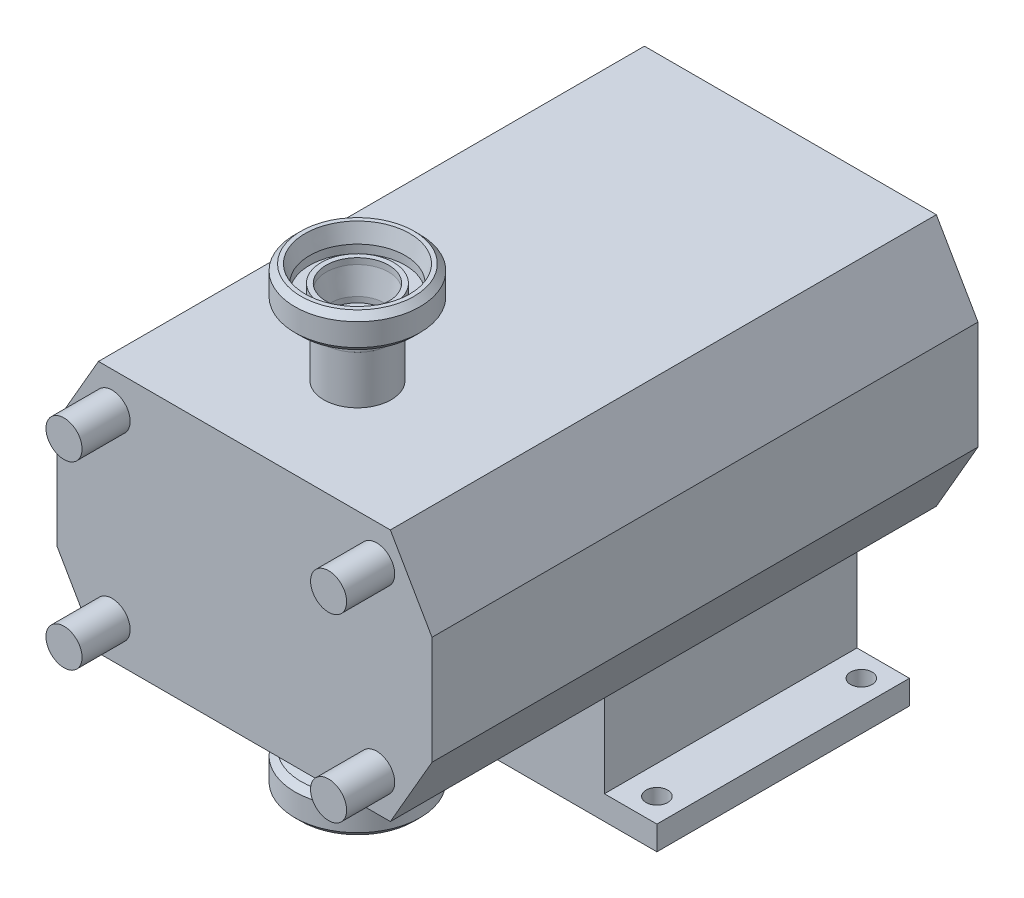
ISO-10303-21;
HEADER;
FILE_DESCRIPTION(('STEP AP214'),'2;1');
FILE_NAME('part.step','',(''),(''),'','','');
FILE_SCHEMA(('AUTOMOTIVE_DESIGN { 1 0 10303 214 1 1 1 1 }'));
ENDSEC;
DATA;
#1=APPLICATION_CONTEXT('core data for automotive mechanical design processes');
#2=APPLICATION_PROTOCOL_DEFINITION('international standard','automotive_design',2000,#1);
#3=PRODUCT_CONTEXT('',#1,'mechanical');
#4=PRODUCT('Part','Part','',(#3));
#5=PRODUCT_RELATED_PRODUCT_CATEGORY('part','',(#4));
#6=PRODUCT_DEFINITION_FORMATION('','',#4);
#7=PRODUCT_DEFINITION_CONTEXT('part definition',#1,'design');
#8=PRODUCT_DEFINITION('design','',#6,#7);
#9=PRODUCT_DEFINITION_SHAPE('','',#8);
#10=(LENGTH_UNIT() NAMED_UNIT(*) SI_UNIT(.MILLI.,.METRE.));
#11=(NAMED_UNIT(*) PLANE_ANGLE_UNIT() SI_UNIT($,.RADIAN.));
#12=(NAMED_UNIT(*) SI_UNIT($,.STERADIAN.) SOLID_ANGLE_UNIT());
#13=UNCERTAINTY_MEASURE_WITH_UNIT(LENGTH_MEASURE(1.E-05),#10,'distance_accuracy_value','');
#14=(GEOMETRIC_REPRESENTATION_CONTEXT(3) GLOBAL_UNCERTAINTY_ASSIGNED_CONTEXT((#13)) GLOBAL_UNIT_ASSIGNED_CONTEXT((#10,
#11,#12)) REPRESENTATION_CONTEXT('',''));
#15=CARTESIAN_POINT('',(0.,0.,0.));
#16=DIRECTION('',(0.,0.,1.));
#17=DIRECTION('',(1.,0.,0.));
#18=AXIS2_PLACEMENT_3D('',#15,#16,#17);
#19=CARTESIAN_POINT('',(-14.9863432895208,-84.,180.639933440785));
#20=DIRECTION('',(0.,-1.,0.));
#21=DIRECTION('',(0.0426622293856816,0.,0.999089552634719));
#22=AXIS2_PLACEMENT_3D('',#19,#20,#21);
#23=PLANE('',#22);
#24=CARTESIAN_POINT('',(0.,-84.,180.));
#25=DIRECTION('',(0.,1.,0.));
#26=DIRECTION('',(-0.0426622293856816,0.,-0.999089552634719));
#27=AXIS2_PLACEMENT_3D('',#24,#25,#26);
#28=CIRCLE('',#27,15.);
#29=CARTESIAN_POINT('',(-0.639933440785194,-84.,165.013656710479));
#30=VERTEX_POINT('',#29);
#31=EDGE_CURVE('P0_E67',#30,#30,#28,.T.);
#32=ORIENTED_EDGE('',*,*,#31,.T.);
#33=EDGE_LOOP('',(#32));
#34=FACE_BOUND('',#33,.T.);
#35=CARTESIAN_POINT('',(0.,-84.,180.));
#36=DIRECTION('',(0.,1.,0.));
#37=DIRECTION('',(-0.0426622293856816,0.,-0.999089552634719));
#38=AXIS2_PLACEMENT_3D('',#35,#36,#37);
#39=CIRCLE('',#38,19.9);
#40=CARTESIAN_POINT('',(-0.848978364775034,-84.,160.118117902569));
#41=VERTEX_POINT('',#40);
#42=EDGE_CURVE('P0_E10',#41,#41,#39,.T.);
#43=ORIENTED_EDGE('',*,*,#42,.F.);
#44=EDGE_LOOP('',(#43));
#45=FACE_BOUND('',#44,.T.);
#46=ADVANCED_FACE('P0_F15',(#34,#45),#23,.T.);
#47=CARTESIAN_POINT('',(0.,-72.5,180.));
#48=DIRECTION('',(0.,1.,0.));
#49=DIRECTION('',(-0.0426622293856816,0.,-0.999089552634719));
#50=AXIS2_PLACEMENT_3D('',#47,#48,#49);
#51=CYLINDRICAL_SURFACE('',#50,19.9);
#52=ORIENTED_EDGE('',*,*,#42,.T.);
#53=EDGE_LOOP('',(#52));
#54=FACE_BOUND('',#53,.T.);
#55=CARTESIAN_POINT('',(0.,-87.5,180.));
#56=DIRECTION('',(0.,1.,0.));
#57=DIRECTION('',(-0.0426622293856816,0.,-0.999089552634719));
#58=AXIS2_PLACEMENT_3D('',#55,#56,#57);
#59=CIRCLE('',#58,19.9);
#60=CARTESIAN_POINT('',(-0.848978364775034,-87.5,160.118117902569));
#61=VERTEX_POINT('',#60);
#62=EDGE_CURVE('P0_E21',#61,#61,#59,.T.);
#63=ORIENTED_EDGE('',*,*,#62,.F.);
#64=EDGE_LOOP('',(#63));
#65=FACE_BOUND('',#64,.T.);
#66=ADVANCED_FACE('P0_F86',(#54,#65),#51,.F.);
#67=CARTESIAN_POINT('',(0.,-94.5,180.));
#68=DIRECTION('',(0.,-1.,0.));
#69=DIRECTION('',(0.0426622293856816,0.,0.999089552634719));
#70=AXIS2_PLACEMENT_3D('',#67,#68,#69);
#71=CONICAL_SURFACE('',#70,21.7756443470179,0.26179938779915);
#72=ORIENTED_EDGE('',*,*,#62,.T.);
#73=EDGE_LOOP('',(#72));
#74=FACE_BOUND('',#73,.T.);
#75=CARTESIAN_POINT('',(0.,-94.5,180.));
#76=DIRECTION('',(0.,1.,0.));
#77=DIRECTION('',(-0.0426622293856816,0.,-0.999089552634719));
#78=AXIS2_PLACEMENT_3D('',#75,#76,#77);
#79=CIRCLE('',#78,21.7756443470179);
#80=CARTESIAN_POINT('',(-0.928997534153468,-94.5,158.244181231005));
#81=VERTEX_POINT('',#80);
#82=EDGE_CURVE('P0_E25',#81,#81,#79,.T.);
#83=ORIENTED_EDGE('',*,*,#82,.F.);
#84=EDGE_LOOP('',(#83));
#85=FACE_BOUND('',#84,.T.);
#86=ADVANCED_FACE('P0_F90',(#74,#85),#71,.F.);
#87=CARTESIAN_POINT('',(-21.7558187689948,-94.5,180.928997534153));
#88=DIRECTION('',(0.,-1.,0.));
#89=DIRECTION('',(0.0426622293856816,0.,0.999089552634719));
#90=AXIS2_PLACEMENT_3D('',#87,#88,#89);
#91=PLANE('',#90);
#92=ORIENTED_EDGE('',*,*,#82,.T.);
#93=EDGE_LOOP('',(#92));
#94=FACE_BOUND('',#93,.T.);
#95=CARTESIAN_POINT('',(0.,-94.5,180.));
#96=DIRECTION('',(0.,1.,0.));
#97=DIRECTION('',(-0.0426622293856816,0.,-0.999089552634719));
#98=AXIS2_PLACEMENT_3D('',#95,#96,#97);
#99=CIRCLE('',#98,23.5);
#100=CARTESIAN_POINT('',(-1.00256239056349,-94.5,156.521395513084));
#101=VERTEX_POINT('',#100);
#102=EDGE_CURVE('P0_E29',#101,#101,#99,.T.);
#103=ORIENTED_EDGE('',*,*,#102,.F.);
#104=EDGE_LOOP('',(#103));
#105=FACE_BOUND('',#104,.T.);
#106=ADVANCED_FACE('P0_F94',(#94,#105),#91,.T.);
#107=CARTESIAN_POINT('',(0.,-92.0000000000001,180.));
#108=DIRECTION('',(0.,1.,0.));
#109=DIRECTION('',(-0.0426622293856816,0.,-0.999089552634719));
#110=AXIS2_PLACEMENT_3D('',#107,#108,#109);
#111=CONICAL_SURFACE('',#110,26.,0.785398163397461);
#112=ORIENTED_EDGE('',*,*,#102,.T.);
#113=EDGE_LOOP('',(#112));
#114=FACE_BOUND('',#113,.T.);
#115=CARTESIAN_POINT('',(0.,-92.0000000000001,180.));
#116=DIRECTION('',(0.,1.,0.));
#117=DIRECTION('',(-0.0426622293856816,0.,-0.999089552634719));
#118=AXIS2_PLACEMENT_3D('',#115,#116,#117);
#119=CIRCLE('',#118,26.);
#120=CARTESIAN_POINT('',(-1.10921796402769,-92.0000000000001,154.023671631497));
#121=VERTEX_POINT('',#120);
#122=EDGE_CURVE('P0_E34',#121,#121,#119,.T.);
#123=ORIENTED_EDGE('',*,*,#122,.F.);
#124=EDGE_LOOP('',(#123));
#125=FACE_BOUND('',#124,.T.);
#126=ADVANCED_FACE('P0_F100',(#114,#125),#111,.T.);
#127=CARTESIAN_POINT('',(0.,-72.5,180.));
#128=DIRECTION('',(0.,1.,0.));
#129=DIRECTION('',(-0.0426622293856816,0.,-0.999089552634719));
#130=AXIS2_PLACEMENT_3D('',#127,#128,#129);
#131=CYLINDRICAL_SURFACE('',#130,26.);
#132=ORIENTED_EDGE('',*,*,#122,.T.);
#133=EDGE_LOOP('',(#132));
#134=FACE_BOUND('',#133,.T.);
#135=CARTESIAN_POINT('',(0.,-82.6751063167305,180.));
#136=DIRECTION('',(0.,1.,0.));
#137=DIRECTION('',(-0.0426622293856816,0.,-0.999089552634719));
#138=AXIS2_PLACEMENT_3D('',#135,#136,#137);
#139=CIRCLE('',#138,26.);
#140=CARTESIAN_POINT('',(-1.10921796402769,-82.6751063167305,154.023671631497));
#141=VERTEX_POINT('',#140);
#142=EDGE_CURVE('P0_E37',#141,#141,#139,.T.);
#143=ORIENTED_EDGE('',*,*,#142,.F.);
#144=EDGE_LOOP('',(#143));
#145=FACE_BOUND('',#144,.T.);
#146=ADVANCED_FACE('P0_F104',(#134,#145),#131,.T.);
#147=CARTESIAN_POINT('',(0.,-80.1751063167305,180.));
#148=DIRECTION('',(0.,-1.,0.));
#149=DIRECTION('',(0.0426622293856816,0.,0.999089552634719));
#150=AXIS2_PLACEMENT_3D('',#147,#148,#149);
#151=CONICAL_SURFACE('',#150,23.5,0.785398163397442);
#152=ORIENTED_EDGE('',*,*,#142,.T.);
#153=EDGE_LOOP('',(#152));
#154=FACE_BOUND('',#153,.T.);
#155=CARTESIAN_POINT('',(0.,-80.1751063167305,180.));
#156=DIRECTION('',(0.,1.,0.));
#157=DIRECTION('',(-0.0426622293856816,0.,-0.999089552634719));
#158=AXIS2_PLACEMENT_3D('',#155,#156,#157);
#159=CIRCLE('',#158,23.5);
#160=CARTESIAN_POINT('',(-1.00256239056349,-80.1751063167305,156.521395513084));
#161=VERTEX_POINT('',#160);
#162=EDGE_CURVE('P0_E40',#161,#161,#159,.T.);
#163=ORIENTED_EDGE('',*,*,#162,.F.);
#164=EDGE_LOOP('',(#163));
#165=FACE_BOUND('',#164,.T.);
#166=ADVANCED_FACE('P0_F108',(#154,#165),#151,.T.);
#167=CARTESIAN_POINT('',(0.,-78.8642703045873,180.));
#168=DIRECTION('',(0.,-1.,0.));
#169=DIRECTION('',(0.0426622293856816,0.,0.999089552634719));
#170=AXIS2_PLACEMENT_3D('',#167,#168,#169);
#171=CONICAL_SURFACE('',#170,16.0658795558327,1.39626340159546);
#172=ORIENTED_EDGE('',*,*,#162,.T.);
#173=EDGE_LOOP('',(#172));
#174=FACE_BOUND('',#173,.T.);
#175=CARTESIAN_POINT('',(0.,-78.8642703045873,180.));
#176=DIRECTION('',(0.,1.,0.));
#177=DIRECTION('',(-0.0426622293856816,0.,-0.999089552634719));
#178=AXIS2_PLACEMENT_3D('',#175,#176,#177);
#179=CIRCLE('',#178,16.0658795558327);
#180=CARTESIAN_POINT('',(-0.685406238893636,-78.8642703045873,163.94874758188));
#181=VERTEX_POINT('',#180);
#182=EDGE_CURVE('P0_E43',#181,#181,#179,.T.);
#183=ORIENTED_EDGE('',*,*,#182,.F.);
#184=EDGE_LOOP('',(#183));
#185=FACE_BOUND('',#184,.T.);
#186=ADVANCED_FACE('P0_F112',(#174,#185),#171,.T.);
#187=CARTESIAN_POINT('',(0.,-76.4022509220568,180.));
#188=DIRECTION('',(0.,1.,0.));
#189=DIRECTION('',(-0.0426622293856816,0.,-0.999089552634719));
#190=AXIS2_PLACEMENT_3D('',#187,#188,#189);
#191=TOROIDAL_SURFACE('',#190,16.5,2.5);
#192=ORIENTED_EDGE('',*,*,#182,.T.);
#193=EDGE_LOOP('',(#192));
#194=FACE_BOUND('',#193,.T.);
#195=CARTESIAN_POINT('',(0.,-76.4022509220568,180.));
#196=DIRECTION('',(0.,1.,0.));
#197=DIRECTION('',(-0.0426622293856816,0.,-0.999089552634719));
#198=AXIS2_PLACEMENT_3D('',#195,#196,#197);
#199=CIRCLE('',#198,14.);
#200=CARTESIAN_POINT('',(-0.597271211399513,-76.4022509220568,166.012746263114));
#201=VERTEX_POINT('',#200);
#202=EDGE_CURVE('P0_E46',#201,#201,#199,.T.);
#203=ORIENTED_EDGE('',*,*,#202,.F.);
#204=EDGE_LOOP('',(#203));
#205=FACE_BOUND('',#204,.T.);
#206=ADVANCED_FACE('P0_F116',(#194,#205),#191,.F.);
#207=CARTESIAN_POINT('',(0.,-72.5,180.));
#208=DIRECTION('',(0.,1.,0.));
#209=DIRECTION('',(-0.0426622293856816,0.,-0.999089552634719));
#210=AXIS2_PLACEMENT_3D('',#207,#208,#209);
#211=CYLINDRICAL_SURFACE('',#210,14.);
#212=ORIENTED_EDGE('',*,*,#202,.T.);
#213=EDGE_LOOP('',(#212));
#214=FACE_BOUND('',#213,.T.);
#215=CARTESIAN_POINT('',(0.,-72.5,180.));
#216=DIRECTION('',(0.,1.,0.));
#217=DIRECTION('',(-0.0426622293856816,0.,-0.999089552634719));
#218=AXIS2_PLACEMENT_3D('',#215,#216,#217);
#219=CIRCLE('',#218,14.);
#220=CARTESIAN_POINT('',(-0.597271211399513,-72.5,166.012746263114));
#221=VERTEX_POINT('',#220);
#222=EDGE_CURVE('P0_E49',#221,#221,#219,.T.);
#223=ORIENTED_EDGE('',*,*,#222,.F.);
#224=EDGE_LOOP('',(#223));
#225=FACE_BOUND('',#224,.T.);
#226=ADVANCED_FACE('P0_F120',(#214,#225),#211,.T.);
#227=CARTESIAN_POINT('',(-11.1898029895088,-72.5,180.47781696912));
#228=DIRECTION('',(0.,1.,0.));
#229=DIRECTION('',(-0.0426622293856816,0.,-0.999089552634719));
#230=AXIS2_PLACEMENT_3D('',#227,#228,#229);
#231=PLANE('',#230);
#232=ORIENTED_EDGE('',*,*,#222,.T.);
#233=EDGE_LOOP('',(#232));
#234=FACE_BOUND('',#233,.T.);
#235=CARTESIAN_POINT('',(0.,-72.5,180.));
#236=DIRECTION('',(0.,1.,0.));
#237=DIRECTION('',(-0.0426622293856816,0.,-0.999089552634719));
#238=AXIS2_PLACEMENT_3D('',#235,#236,#237);
#239=CIRCLE('',#238,11.2);
#240=CARTESIAN_POINT('',(-0.477816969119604,-72.5,168.810197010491));
#241=VERTEX_POINT('',#240);
#242=EDGE_CURVE('P0_E52',#241,#241,#239,.T.);
#243=ORIENTED_EDGE('',*,*,#242,.F.);
#244=EDGE_LOOP('',(#243));
#245=FACE_BOUND('',#244,.T.);
#246=ADVANCED_FACE('P0_F124',(#234,#245),#231,.T.);
#247=CARTESIAN_POINT('',(0.,-72.5,180.));
#248=DIRECTION('',(0.,1.,0.));
#249=DIRECTION('',(-0.0426622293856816,0.,-0.999089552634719));
#250=AXIS2_PLACEMENT_3D('',#247,#248,#249);
#251=CYLINDRICAL_SURFACE('',#250,11.2);
#252=ORIENTED_EDGE('',*,*,#242,.T.);
#253=EDGE_LOOP('',(#252));
#254=FACE_BOUND('',#253,.T.);
#255=CARTESIAN_POINT('',(0.,-74.7916927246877,180.));
#256=DIRECTION('',(0.,1.,0.));
#257=DIRECTION('',(-0.0426622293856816,0.,-0.999089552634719));
#258=AXIS2_PLACEMENT_3D('',#255,#256,#257);
#259=CIRCLE('',#258,11.2);
#260=CARTESIAN_POINT('',(-0.477816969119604,-74.7916927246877,168.810197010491));
#261=VERTEX_POINT('',#260);
#262=EDGE_CURVE('P0_E55',#261,#261,#259,.T.);
#263=ORIENTED_EDGE('',*,*,#262,.F.);
#264=EDGE_LOOP('',(#263));
#265=FACE_BOUND('',#264,.T.);
#266=ADVANCED_FACE('P0_F128',(#254,#265),#251,.F.);
#267=CARTESIAN_POINT('',(0.,-85.,180.));
#268=DIRECTION('',(0.,-1.,0.));
#269=DIRECTION('',(0.0426622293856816,0.,0.999089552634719));
#270=AXIS2_PLACEMENT_3D('',#267,#268,#269);
#271=CONICAL_SURFACE('',#270,13.,0.174532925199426);
#272=ORIENTED_EDGE('',*,*,#262,.T.);
#273=EDGE_LOOP('',(#272));
#274=FACE_BOUND('',#273,.T.);
#275=CARTESIAN_POINT('',(0.,-85.,180.));
#276=DIRECTION('',(0.,1.,0.));
#277=DIRECTION('',(-0.0426622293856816,0.,-0.999089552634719));
#278=AXIS2_PLACEMENT_3D('',#275,#276,#277);
#279=CIRCLE('',#278,13.);
#280=CARTESIAN_POINT('',(-0.554608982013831,-85.,167.011835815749));
#281=VERTEX_POINT('',#280);
#282=EDGE_CURVE('P0_E58',#281,#281,#279,.T.);
#283=ORIENTED_EDGE('',*,*,#282,.F.);
#284=EDGE_LOOP('',(#283));
#285=FACE_BOUND('',#284,.T.);
#286=ADVANCED_FACE('P0_F132',(#274,#285),#271,.F.);
#287=CARTESIAN_POINT('',(0.,-72.5,180.));
#288=DIRECTION('',(0.,1.,0.));
#289=DIRECTION('',(-0.0426622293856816,0.,-0.999089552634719));
#290=AXIS2_PLACEMENT_3D('',#287,#288,#289);
#291=CYLINDRICAL_SURFACE('',#290,13.);
#292=ORIENTED_EDGE('',*,*,#282,.T.);
#293=EDGE_LOOP('',(#292));
#294=FACE_BOUND('',#293,.T.);
#295=CARTESIAN_POINT('',(0.,-87.5,180.));
#296=DIRECTION('',(0.,1.,0.));
#297=DIRECTION('',(-0.0426622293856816,0.,-0.999089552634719));
#298=AXIS2_PLACEMENT_3D('',#295,#296,#297);
#299=CIRCLE('',#298,13.);
#300=CARTESIAN_POINT('',(-0.554608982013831,-87.5,167.011835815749));
#301=VERTEX_POINT('',#300);
#302=EDGE_CURVE('P0_E61',#301,#301,#299,.T.);
#303=ORIENTED_EDGE('',*,*,#302,.F.);
#304=EDGE_LOOP('',(#303));
#305=FACE_BOUND('',#304,.T.);
#306=ADVANCED_FACE('P0_F82',(#294,#305),#291,.F.);
#307=CARTESIAN_POINT('',(-12.9881641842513,-87.5,180.554608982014));
#308=DIRECTION('',(0.,-1.,0.));
#309=DIRECTION('',(0.0426622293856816,0.,0.999089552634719));
#310=AXIS2_PLACEMENT_3D('',#307,#308,#309);
#311=PLANE('',#310);
#312=ORIENTED_EDGE('',*,*,#302,.T.);
#313=EDGE_LOOP('',(#312));
#314=FACE_BOUND('',#313,.T.);
#315=CARTESIAN_POINT('',(0.,-87.5,180.));
#316=DIRECTION('',(0.,1.,0.));
#317=DIRECTION('',(-0.0426622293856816,0.,-0.999089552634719));
#318=AXIS2_PLACEMENT_3D('',#315,#316,#317);
#319=CIRCLE('',#318,15.);
#320=CARTESIAN_POINT('',(-0.639933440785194,-87.5,165.013656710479));
#321=VERTEX_POINT('',#320);
#322=EDGE_CURVE('P0_E64',#321,#321,#319,.T.);
#323=ORIENTED_EDGE('',*,*,#322,.F.);
#324=EDGE_LOOP('',(#323));
#325=FACE_BOUND('',#324,.T.);
#326=ADVANCED_FACE('P0_F75',(#314,#325),#311,.T.);
#327=CARTESIAN_POINT('',(0.,-72.5,180.));
#328=DIRECTION('',(0.,1.,0.));
#329=DIRECTION('',(-0.0426622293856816,0.,-0.999089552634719));
#330=AXIS2_PLACEMENT_3D('',#327,#328,#329);
#331=CYLINDRICAL_SURFACE('',#330,15.);
#332=ORIENTED_EDGE('',*,*,#322,.T.);
#333=EDGE_LOOP('',(#332));
#334=FACE_BOUND('',#333,.T.);
#335=ORIENTED_EDGE('',*,*,#31,.F.);
#336=EDGE_LOOP('',(#335));
#337=FACE_BOUND('',#336,.T.);
#338=ADVANCED_FACE('P0_F73',(#334,#337),#331,.T.);
#339=CLOSED_SHELL('',(#46,#66,#86,#106,#126,#146,#166,#186,#206,#226,#246,#266,#286,#306,#326,#338));
#340=MANIFOLD_SOLID_BREP('P0_B1',#339);
#341=CARTESIAN_POINT('',(-25.,0.,241.732657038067));
#342=DIRECTION('',(0.,0.,1.));
#343=DIRECTION('',(1.,0.,0.));
#344=AXIS2_PLACEMENT_3D('',#341,#342,#343);
#345=CYLINDRICAL_SURFACE('',#344,9.5);
#346=CARTESIAN_POINT('',(-25.,0.,-2.));
#347=DIRECTION('',(0.,0.,1.));
#348=DIRECTION('',(1.,0.,0.));
#349=AXIS2_PLACEMENT_3D('',#346,#347,#348);
#350=CIRCLE('',#349,9.5);
#351=CARTESIAN_POINT('',(-15.5,0.,-2.));
#352=VERTEX_POINT('',#351);
#353=EDGE_CURVE('P1_E277',#352,#352,#350,.T.);
#354=ORIENTED_EDGE('',*,*,#353,.F.);
#355=EDGE_LOOP('',(#354));
#356=FACE_BOUND('',#355,.T.);
#357=DIRECTION('',(0.,0.,1.));
#358=VECTOR('',#357,1.);
#359=CARTESIAN_POINT('',(-15.98612181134,2.99999999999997,241.732657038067));
#360=LINE('',#359,#358);
#361=CARTESIAN_POINT('',(-15.98612181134,3.,-42.));
#362=VERTEX_POINT('',#361);
#363=CARTESIAN_POINT('',(-15.98612181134,3.,-22.));
#364=VERTEX_POINT('',#363);
#365=EDGE_CURVE('P1_E178',#362,#364,#360,.T.);
#366=ORIENTED_EDGE('',*,*,#365,.F.);
#367=CARTESIAN_POINT('',(-25.,0.,-42.));
#368=DIRECTION('',(0.,0.,1.));
#369=DIRECTION('',(1.,0.,0.));
#370=AXIS2_PLACEMENT_3D('',#367,#368,#369);
#371=CIRCLE('',#370,9.5);
#372=CARTESIAN_POINT('',(-15.98612181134,-3.,-42.));
#373=VERTEX_POINT('',#372);
#374=EDGE_CURVE('P1_E176',#362,#373,#371,.T.);
#375=ORIENTED_EDGE('',*,*,#374,.T.);
#376=DIRECTION('',(0.,0.,1.));
#377=VECTOR('',#376,1.);
#378=CARTESIAN_POINT('',(-15.98612181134,-3.00000000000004,241.732657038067));
#379=LINE('',#378,#377);
#380=CARTESIAN_POINT('',(-15.98612181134,-3.00000000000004,-22.));
#381=VERTEX_POINT('',#380);
#382=EDGE_CURVE('P1_E39',#381,#373,#379,.F.);
#383=ORIENTED_EDGE('',*,*,#382,.F.);
#384=CARTESIAN_POINT('',(-15.5,0.,-25.));
#385=CARTESIAN_POINT('',(-15.5000006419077,0.16416708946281,-24.9999991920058));
#386=CARTESIAN_POINT('',(-15.5042954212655,0.328342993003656,-24.9864802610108));
#387=CARTESIAN_POINT('',(-15.5210070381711,0.651888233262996,-24.9329071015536));
#388=CARTESIAN_POINT('',(-15.5334255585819,0.811256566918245,-24.8928473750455));
#389=CARTESIAN_POINT('',(-15.5650291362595,1.12047453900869,-24.787682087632));
#390=CARTESIAN_POINT('',(-15.5842035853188,1.2703386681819,-24.7226157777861));
#391=CARTESIAN_POINT('',(-15.6273427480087,1.55702915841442,-24.5694529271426));
#392=CARTESIAN_POINT('',(-15.6513082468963,1.69385337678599,-24.4813526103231));
#393=CARTESIAN_POINT('',(-15.7023324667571,1.95488615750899,-24.2817053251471));
#394=CARTESIAN_POINT('',(-15.7294596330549,2.07862693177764,-24.1695643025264));
#395=CARTESIAN_POINT('',(-15.7833564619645,2.30589485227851,-23.9262834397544));
#396=CARTESIAN_POINT('',(-15.8101260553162,2.4094181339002,-23.7951399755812));
#397=CARTESIAN_POINT('',(-15.8610140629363,2.59586933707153,-23.5135024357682));
#398=CARTESIAN_POINT('',(-15.8850481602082,2.67820924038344,-23.3626023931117));
#399=CARTESIAN_POINT('',(-15.9267127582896,2.81614778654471,-23.0482150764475));
#400=CARTESIAN_POINT('',(-15.9443449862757,2.87175364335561,-22.8847312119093));
#401=CARTESIAN_POINT('',(-15.9704927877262,2.95292728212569,-22.5551021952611));
#402=CARTESIAN_POINT('',(-15.979271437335,2.97936420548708,-22.3891925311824));
#403=CARTESIAN_POINT('',(-15.9874987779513,3.00416514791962,-22.0550782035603));
#404=CARTESIAN_POINT('',(-15.9869500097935,3.00253681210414,-21.8868741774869));
#405=CARTESIAN_POINT('',(-15.9768164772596,2.97193247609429,-21.5601689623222));
#406=CARTESIAN_POINT('',(-15.9675982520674,2.94406576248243,-21.4015505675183));
#407=CARTESIAN_POINT('',(-15.9417605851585,2.86357596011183,-21.0913669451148));
#408=CARTESIAN_POINT('',(-15.9251403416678,2.81095018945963,-20.9398024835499));
#409=CARTESIAN_POINT('',(-15.8860934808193,2.68166168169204,-20.6454054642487));
#410=CARTESIAN_POINT('',(-15.8635843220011,2.60465367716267,-20.5027359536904));
#411=CARTESIAN_POINT('',(-15.8153331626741,2.4290264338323,-20.2319823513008));
#412=CARTESIAN_POINT('',(-15.7895903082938,2.33040148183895,-20.103902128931));
#413=CARTESIAN_POINT('',(-15.7363062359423,2.10891443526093,-19.859697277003));
#414=CARTESIAN_POINT('',(-15.7087370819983,1.98513792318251,-19.7444065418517));
#415=CARTESIAN_POINT('',(-15.6559621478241,1.71966506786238,-19.5360135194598));
#416=CARTESIAN_POINT('',(-15.6307565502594,1.57796734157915,-19.4429129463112));
#417=CARTESIAN_POINT('',(-15.5852743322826,1.27904248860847,-19.2809619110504));
#418=CARTESIAN_POINT('',(-15.5650393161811,1.12169880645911,-19.2123141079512));
#419=CARTESIAN_POINT('',(-15.5320787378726,0.796908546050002,-19.102710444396));
#420=CARTESIAN_POINT('',(-15.5193508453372,0.629465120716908,-19.0617459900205));
#421=CARTESIAN_POINT('',(-15.5032152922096,0.296303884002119,-19.0101010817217));
#422=CARTESIAN_POINT('',(-15.4994604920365,0.130777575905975,-18.9982920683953));
#423=CARTESIAN_POINT('',(-15.5006652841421,-0.199911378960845,-19.0021062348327));
#424=CARTESIAN_POINT('',(-15.5056235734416,-0.365074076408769,-19.017725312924));
#425=CARTESIAN_POINT('',(-15.5234691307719,-0.685969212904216,-19.0750481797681));
#426=CARTESIAN_POINT('',(-15.5361511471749,-0.841834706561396,-19.1160771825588));
#427=CARTESIAN_POINT('',(-15.5679556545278,-1.14442314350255,-19.2222287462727));
#428=CARTESIAN_POINT('',(-15.5870789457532,-1.2911449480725,-19.2873543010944));
#429=CARTESIAN_POINT('',(-15.6303910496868,-1.57531276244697,-19.4416461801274));
#430=CARTESIAN_POINT('',(-15.6546933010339,-1.71244019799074,-19.5313665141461));
#431=CARTESIAN_POINT('',(-15.7055878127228,-1.97006979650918,-19.7316386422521));
#432=CARTESIAN_POINT('',(-15.7321807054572,-2.09056734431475,-19.8421961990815));
#433=CARTESIAN_POINT('',(-15.7860170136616,-2.31658675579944,-20.0863131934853));
#434=CARTESIAN_POINT('',(-15.813243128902,-2.42130400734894,-20.2206231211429));
#435=CARTESIAN_POINT('',(-15.8641405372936,-2.60679013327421,-20.5055000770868));
#436=CARTESIAN_POINT('',(-15.8878118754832,-2.68755931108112,-20.6560668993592));
#437=CARTESIAN_POINT('',(-15.9286607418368,-2.82237097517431,-20.9689238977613));
#438=CARTESIAN_POINT('',(-15.9458617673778,-2.87651039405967,-21.1311690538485));
#439=CARTESIAN_POINT('',(-15.9716606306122,-2.95649944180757,-21.4631296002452));
#440=CARTESIAN_POINT('',(-15.9802618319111,-2.9823601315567,-21.6328420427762));
#441=CARTESIAN_POINT('',(-15.9875316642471,-3.0042524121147,-21.9664938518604));
#442=CARTESIAN_POINT('',(-15.9866406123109,-3.00160628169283,-22.1303379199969));
#443=CARTESIAN_POINT('',(-15.9760989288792,-2.96976166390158,-22.4551233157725));
#444=CARTESIAN_POINT('',(-15.9664487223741,-2.94056446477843,-22.6160647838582));
#445=CARTESIAN_POINT('',(-15.9397869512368,-2.8573397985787,-22.928056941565));
#446=CARTESIAN_POINT('',(-15.9228900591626,-2.80369834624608,-23.0792211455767));
#447=CARTESIAN_POINT('',(-15.8836701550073,-2.67341300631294,-23.3705239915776));
#448=CARTESIAN_POINT('',(-15.8613460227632,-2.59676436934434,-23.5106603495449));
#449=CARTESIAN_POINT('',(-15.8126776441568,-2.4190708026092,-23.781973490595));
#450=CARTESIAN_POINT('',(-15.7862086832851,-2.31717569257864,-23.9125710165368));
#451=CARTESIAN_POINT('',(-15.7327983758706,-2.0933684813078,-24.1552416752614));
#452=CARTESIAN_POINT('',(-15.705856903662,-1.97145098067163,-24.2673097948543));
#453=CARTESIAN_POINT('',(-15.6534511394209,-1.7061326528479,-24.4735138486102));
#454=CARTESIAN_POINT('',(-15.6280668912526,-1.56214764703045,-24.5669207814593));
#455=CARTESIAN_POINT('',(-15.5826524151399,-1.25971894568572,-24.728083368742));
#456=CARTESIAN_POINT('',(-15.5626201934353,-1.10128066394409,-24.7958485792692));
#457=CARTESIAN_POINT('',(-15.531467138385,-0.787271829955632,-24.8991975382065));
#458=CARTESIAN_POINT('',(-15.5197707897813,-0.632450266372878,-24.9368877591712));
#459=CARTESIAN_POINT('',(-15.5040377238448,-0.318421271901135,-24.9872867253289));
#460=CARTESIAN_POINT('',(-15.4999993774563,-0.159214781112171,-25.00000078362));
#461=CARTESIAN_POINT('',(-15.5,0.,-25.));
#462=B_SPLINE_CURVE_WITH_KNOTS('',3,(#384,#385,#386,#387,#388,#389,#390,#391,#392,#393,#394,
#395,#396,#397,#398,#399,#400,#401,#402,#403,#404,#405,#406,#407,#408,#409,#410,#411,#412,#413,
#414,#415,#416,#417,#418,#419,#420,#421,#422,#423,#424,#425,#426,#427,#428,#429,#430,#431,#432,
#433,#434,#435,#436,#437,#438,#439,#440,#441,#442,#443,#444,#445,#446,#447,#448,#449,#450,#451,
#452,#453,#454,#455,#456,#457,#458,#459,#460,#461),.UNSPECIFIED.,.T.,.F.,(4,2,2,2,2,2,2,2,2,2,2,
2,2,2,2,2,2,2,2,2,2,2,2,2,2,2,2,2,2,2,2,2,2,2,2,2,2,2,4),(0.,0.491915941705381,
0.983933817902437,1.47518254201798,1.96651184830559,2.47177433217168,2.97713330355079,
3.49529138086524,4.0133095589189,4.51543663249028,5.01742692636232,5.49910423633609,
5.98083373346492,6.46971527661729,6.95872618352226,7.47049694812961,7.98230723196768,
8.49826565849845,9.01406383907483,9.50955937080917,10.0049808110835,10.487778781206,
10.9706367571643,11.4654198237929,11.9603399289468,12.4753133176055,12.9902801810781,
13.5033584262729,14.0162359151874,14.5054301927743,14.9946007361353,15.4763007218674,
15.9581002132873,16.4590917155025,16.9602185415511,17.4781824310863,17.9959530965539,
18.4731312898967,18.9502079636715),.UNSPECIFIED.);
#463=EDGE_CURVE('P1_E11',#364,#381,#462,.T.);
#464=ORIENTED_EDGE('',*,*,#463,.F.);
#465=EDGE_LOOP('',(#366,#375,#383,#464));
#466=FACE_BOUND('',#465,.T.);
#467=ADVANCED_FACE('P1_F17',(#356,#466),#345,.T.);
#468=CARTESIAN_POINT('',(-60.6794919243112,-52.5,227.));
#469=DIRECTION('',(0.,1.,0.));
#470=DIRECTION('',(-1.,0.,0.));
#471=AXIS2_PLACEMENT_3D('',#468,#469,#470);
#472=PLANE('',#471);
#473=CARTESIAN_POINT('',(0.,-52.5,180.));
#474=DIRECTION('',(0.,1.,0.));
#475=DIRECTION('',(-1.,0.,0.));
#476=AXIS2_PLACEMENT_3D('',#473,#474,#475);
#477=CIRCLE('',#476,14.);
#478=CARTESIAN_POINT('',(-14.,-52.5,180.));
#479=VERTEX_POINT('',#478);
#480=EDGE_CURVE('P1_E192',#479,#479,#477,.T.);
#481=ORIENTED_EDGE('',*,*,#480,.T.);
#482=EDGE_LOOP('',(#481));
#483=FACE_BOUND('',#482,.T.);
#484=DIRECTION('',(1.,0.,0.));
#485=VECTOR('',#484,1.);
#486=CARTESIAN_POINT('',(-60.6794919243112,-52.5,0.));
#487=LINE('',#486,#485);
#488=CARTESIAN_POINT('',(-60.6794919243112,-52.5,0.));
#489=VERTEX_POINT('',#488);
#490=CARTESIAN_POINT('',(60.6794919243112,-52.5,0.));
#491=VERTEX_POINT('',#490);
#492=EDGE_CURVE('P1_E337',#489,#491,#487,.T.);
#493=ORIENTED_EDGE('',*,*,#492,.T.);
#494=DIRECTION('',(0.,0.,-1.));
#495=VECTOR('',#494,1.);
#496=CARTESIAN_POINT('',(60.6794919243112,-52.5,227.));
#497=LINE('',#496,#495);
#498=CARTESIAN_POINT('',(60.6794919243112,-52.5,227.));
#499=VERTEX_POINT('',#498);
#500=EDGE_CURVE('P1_E347',#499,#491,#497,.T.);
#501=ORIENTED_EDGE('',*,*,#500,.F.);
#502=DIRECTION('',(1.,0.,0.));
#503=VECTOR('',#502,1.);
#504=CARTESIAN_POINT('',(-60.6794919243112,-52.5,227.));
#505=LINE('',#504,#503);
#506=CARTESIAN_POINT('',(-60.6794919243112,-52.5,227.));
#507=VERTEX_POINT('',#506);
#508=EDGE_CURVE('P1_E320',#507,#499,#505,.T.);
#509=ORIENTED_EDGE('',*,*,#508,.F.);
#510=DIRECTION('',(0.,0.,-1.));
#511=VECTOR('',#510,1.);
#512=CARTESIAN_POINT('',(-60.6794919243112,-52.5,227.));
#513=LINE('',#512,#511);
#514=EDGE_CURVE('P1_E350',#507,#489,#513,.T.);
#515=ORIENTED_EDGE('',*,*,#514,.T.);
#516=EDGE_LOOP('',(#493,#501,#509,#515));
#517=FACE_BOUND('',#516,.T.);
#518=DIRECTION('',(1.,0.,0.));
#519=VECTOR('',#518,1.);
#520=CARTESIAN_POINT('',(45.6794919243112,-52.5,18.));
#521=LINE('',#520,#519);
#522=CARTESIAN_POINT('',(-45.6794919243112,-52.5,18.));
#523=VERTEX_POINT('',#522);
#524=CARTESIAN_POINT('',(45.6794919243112,-52.5,18.));
#525=VERTEX_POINT('',#524);
#526=EDGE_CURVE('P1_E220',#523,#525,#521,.T.);
#527=ORIENTED_EDGE('',*,*,#526,.F.);
#528=DIRECTION('',(0.,0.,1.));
#529=VECTOR('',#528,1.);
#530=CARTESIAN_POINT('',(-45.6794919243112,-52.5,18.));
#531=LINE('',#530,#529);
#532=CARTESIAN_POINT('',(-45.6794919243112,-52.5,123.));
#533=VERTEX_POINT('',#532);
#534=EDGE_CURVE('P1_E238',#523,#533,#531,.T.);
#535=ORIENTED_EDGE('',*,*,#534,.T.);
#536=DIRECTION('',(1.,0.,0.));
#537=VECTOR('',#536,1.);
#538=CARTESIAN_POINT('',(45.6794919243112,-52.5,123.));
#539=LINE('',#538,#537);
#540=CARTESIAN_POINT('',(45.6794919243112,-52.5,123.));
#541=VERTEX_POINT('',#540);
#542=EDGE_CURVE('P1_E219',#533,#541,#539,.T.);
#543=ORIENTED_EDGE('',*,*,#542,.T.);
#544=DIRECTION('',(0.,0.,1.));
#545=VECTOR('',#544,1.);
#546=CARTESIAN_POINT('',(45.6794919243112,-52.5,18.));
#547=LINE('',#546,#545);
#548=EDGE_CURVE('P1_E274',#525,#541,#547,.T.);
#549=ORIENTED_EDGE('',*,*,#548,.F.);
#550=EDGE_LOOP('',(#527,#535,#543,#549));
#551=FACE_BOUND('',#550,.T.);
#552=ADVANCED_FACE('P1_F393',(#483,#517,#551),#472,.F.);
#553=CARTESIAN_POINT('',(90.9903810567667,0.,0.));
#554=DIRECTION('',(0.,0.,1.));
#555=DIRECTION('',(1.,0.,0.));
#556=AXIS2_PLACEMENT_3D('',#553,#554,#555);
#557=PLANE('',#556);
#558=DIRECTION('',(-0.500000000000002,0.866025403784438,0.));
#559=VECTOR('',#558,1.);
#560=CARTESIAN_POINT('',(60.6794919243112,52.5,0.));
#561=LINE('',#560,#559);
#562=CARTESIAN_POINT('',(78.,22.5,0.));
#563=VERTEX_POINT('',#562);
#564=CARTESIAN_POINT('',(60.6794919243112,52.5,0.));
#565=VERTEX_POINT('',#564);
#566=EDGE_CURVE('P1_E305',#563,#565,#561,.T.);
#567=ORIENTED_EDGE('',*,*,#566,.F.);
#568=DIRECTION('',(0.,1.,0.));
#569=VECTOR('',#568,1.);
#570=CARTESIAN_POINT('',(78.,22.5,0.));
#571=LINE('',#570,#569);
#572=CARTESIAN_POINT('',(78.,-22.5,0.));
#573=VERTEX_POINT('',#572);
#574=EDGE_CURVE('P1_E312',#573,#563,#571,.T.);
#575=ORIENTED_EDGE('',*,*,#574,.F.);
#576=DIRECTION('',(0.500000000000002,0.866025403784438,0.));
#577=VECTOR('',#576,1.);
#578=CARTESIAN_POINT('',(60.6794919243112,-52.5,0.));
#579=LINE('',#578,#577);
#580=EDGE_CURVE('P1_E339',#491,#573,#579,.T.);
#581=ORIENTED_EDGE('',*,*,#580,.F.);
#582=ORIENTED_EDGE('',*,*,#492,.F.);
#583=DIRECTION('',(0.500000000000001,-0.866025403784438,0.));
#584=VECTOR('',#583,1.);
#585=CARTESIAN_POINT('',(-60.6794919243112,-52.5,0.));
#586=LINE('',#585,#584);
#587=CARTESIAN_POINT('',(-78.,-22.5,0.));
#588=VERTEX_POINT('',#587);
#589=EDGE_CURVE('P1_E335',#588,#489,#586,.T.);
#590=ORIENTED_EDGE('',*,*,#589,.F.);
#591=DIRECTION('',(0.,-1.,0.));
#592=VECTOR('',#591,1.);
#593=CARTESIAN_POINT('',(-78.,22.5,0.));
#594=LINE('',#593,#592);
#595=CARTESIAN_POINT('',(-78.,22.5,0.));
#596=VERTEX_POINT('',#595);
#597=EDGE_CURVE('P1_E333',#596,#588,#594,.T.);
#598=ORIENTED_EDGE('',*,*,#597,.F.);
#599=DIRECTION('',(-0.500000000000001,-0.866025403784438,0.));
#600=VECTOR('',#599,1.);
#601=CARTESIAN_POINT('',(-60.6794919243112,52.5,0.));
#602=LINE('',#601,#600);
#603=CARTESIAN_POINT('',(-60.6794919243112,52.5,0.));
#604=VERTEX_POINT('',#603);
#605=EDGE_CURVE('P1_E331',#604,#596,#602,.T.);
#606=ORIENTED_EDGE('',*,*,#605,.F.);
#607=DIRECTION('',(-1.,0.,0.));
#608=VECTOR('',#607,1.);
#609=CARTESIAN_POINT('',(-60.6794919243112,52.5,0.));
#610=LINE('',#609,#608);
#611=EDGE_CURVE('P1_E329',#565,#604,#610,.T.);
#612=ORIENTED_EDGE('',*,*,#611,.F.);
#613=EDGE_LOOP('',(#567,#575,#581,#582,#590,#598,#606,#612));
#614=FACE_BOUND('',#613,.T.);
#615=CARTESIAN_POINT('',(-25.,0.,0.));
#616=DIRECTION('',(0.,0.,1.));
#617=DIRECTION('',(1.,0.,0.));
#618=AXIS2_PLACEMENT_3D('',#615,#616,#617);
#619=CIRCLE('',#618,12.5);
#620=CARTESIAN_POINT('',(-12.5,0.,0.));
#621=VERTEX_POINT('',#620);
#622=EDGE_CURVE('P1_E29',#621,#621,#619,.F.);
#623=ORIENTED_EDGE('',*,*,#622,.F.);
#624=EDGE_LOOP('',(#623));
#625=FACE_BOUND('',#624,.T.);
#626=ADVANCED_FACE('P1_F399',(#614,#625),#557,.F.);
#627=CARTESIAN_POINT('',(90.9903810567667,0.,227.));
#628=DIRECTION('',(0.,0.,1.));
#629=DIRECTION('',(1.,0.,0.));
#630=AXIS2_PLACEMENT_3D('',#627,#628,#629);
#631=PLANE('',#630);
#632=CARTESIAN_POINT('',(55.,-37.5,227.));
#633=DIRECTION('',(0.,0.,1.));
#634=DIRECTION('',(1.,0.,0.));
#635=AXIS2_PLACEMENT_3D('',#632,#633,#634);
#636=CIRCLE('',#635,7.49999999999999);
#637=CARTESIAN_POINT('',(62.5,-37.5,227.));
#638=VERTEX_POINT('',#637);
#639=EDGE_CURVE('P1_E287',#638,#638,#636,.T.);
#640=ORIENTED_EDGE('',*,*,#639,.F.);
#641=EDGE_LOOP('',(#640));
#642=FACE_BOUND('',#641,.T.);
#643=CARTESIAN_POINT('',(-55.,37.5,227.));
#644=DIRECTION('',(0.,0.,1.));
#645=DIRECTION('',(1.,0.,0.));
#646=AXIS2_PLACEMENT_3D('',#643,#644,#645);
#647=CIRCLE('',#646,7.5);
#648=CARTESIAN_POINT('',(-47.5,37.5,227.));
#649=VERTEX_POINT('',#648);
#650=EDGE_CURVE('P1_E299',#649,#649,#647,.T.);
#651=ORIENTED_EDGE('',*,*,#650,.F.);
#652=EDGE_LOOP('',(#651));
#653=FACE_BOUND('',#652,.T.);
#654=DIRECTION('',(-0.500000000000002,0.866025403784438,0.));
#655=VECTOR('',#654,1.);
#656=CARTESIAN_POINT('',(60.6794919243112,52.5,227.));
#657=LINE('',#656,#655);
#658=CARTESIAN_POINT('',(78.,22.5,227.));
#659=VERTEX_POINT('',#658);
#660=CARTESIAN_POINT('',(60.6794919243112,52.5,227.));
#661=VERTEX_POINT('',#660);
#662=EDGE_CURVE('P1_E308',#659,#661,#657,.T.);
#663=ORIENTED_EDGE('',*,*,#662,.T.);
#664=DIRECTION('',(-1.,0.,0.));
#665=VECTOR('',#664,1.);
#666=CARTESIAN_POINT('',(-60.6794919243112,52.5,227.));
#667=LINE('',#666,#665);
#668=CARTESIAN_POINT('',(-60.6794919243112,52.5,227.));
#669=VERTEX_POINT('',#668);
#670=EDGE_CURVE('P1_E311',#661,#669,#667,.T.);
#671=ORIENTED_EDGE('',*,*,#670,.T.);
#672=DIRECTION('',(-0.500000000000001,-0.866025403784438,0.));
#673=VECTOR('',#672,1.);
#674=CARTESIAN_POINT('',(-60.6794919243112,52.5,227.));
#675=LINE('',#674,#673);
#676=CARTESIAN_POINT('',(-78.,22.5,227.));
#677=VERTEX_POINT('',#676);
#678=EDGE_CURVE('P1_E314',#669,#677,#675,.T.);
#679=ORIENTED_EDGE('',*,*,#678,.T.);
#680=DIRECTION('',(0.,-1.,0.));
#681=VECTOR('',#680,1.);
#682=CARTESIAN_POINT('',(-78.,22.5,227.));
#683=LINE('',#682,#681);
#684=CARTESIAN_POINT('',(-78.,-22.5,227.));
#685=VERTEX_POINT('',#684);
#686=EDGE_CURVE('P1_E316',#677,#685,#683,.T.);
#687=ORIENTED_EDGE('',*,*,#686,.T.);
#688=DIRECTION('',(0.500000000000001,-0.866025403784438,0.));
#689=VECTOR('',#688,1.);
#690=CARTESIAN_POINT('',(-60.6794919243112,-52.5,227.));
#691=LINE('',#690,#689);
#692=EDGE_CURVE('P1_E318',#685,#507,#691,.T.);
#693=ORIENTED_EDGE('',*,*,#692,.T.);
#694=ORIENTED_EDGE('',*,*,#508,.T.);
#695=DIRECTION('',(0.500000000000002,0.866025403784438,0.));
#696=VECTOR('',#695,1.);
#697=CARTESIAN_POINT('',(60.6794919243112,-52.5,227.));
#698=LINE('',#697,#696);
#699=CARTESIAN_POINT('',(78.,-22.5,227.));
#700=VERTEX_POINT('',#699);
#701=EDGE_CURVE('P1_E322',#499,#700,#698,.T.);
#702=ORIENTED_EDGE('',*,*,#701,.T.);
#703=DIRECTION('',(0.,1.,0.));
#704=VECTOR('',#703,1.);
#705=CARTESIAN_POINT('',(78.,22.5,227.));
#706=LINE('',#705,#704);
#707=EDGE_CURVE('P1_E324',#700,#659,#706,.T.);
#708=ORIENTED_EDGE('',*,*,#707,.T.);
#709=EDGE_LOOP('',(#663,#671,#679,#687,#693,#694,#702,#708));
#710=FACE_BOUND('',#709,.T.);
#711=CARTESIAN_POINT('',(55.,37.5,227.));
#712=DIRECTION('',(0.,0.,1.));
#713=DIRECTION('',(1.,0.,0.));
#714=AXIS2_PLACEMENT_3D('',#711,#712,#713);
#715=CIRCLE('',#714,7.49999999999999);
#716=CARTESIAN_POINT('',(62.5,37.5,227.));
#717=VERTEX_POINT('',#716);
#718=EDGE_CURVE('P1_E293',#717,#717,#715,.T.);
#719=ORIENTED_EDGE('',*,*,#718,.F.);
#720=EDGE_LOOP('',(#719));
#721=FACE_BOUND('',#720,.T.);
#722=CARTESIAN_POINT('',(-55.,-37.5,227.));
#723=DIRECTION('',(0.,0.,1.));
#724=DIRECTION('',(1.,0.,0.));
#725=AXIS2_PLACEMENT_3D('',#722,#723,#724);
#726=CIRCLE('',#725,7.5);
#727=CARTESIAN_POINT('',(-47.5,-37.5,227.));
#728=VERTEX_POINT('',#727);
#729=EDGE_CURVE('P1_E283',#728,#728,#726,.T.);
#730=ORIENTED_EDGE('',*,*,#729,.F.);
#731=EDGE_LOOP('',(#730));
#732=FACE_BOUND('',#731,.T.);
#733=ADVANCED_FACE('P1_F448',(#642,#653,#710,#721,#732),#631,.T.);
#734=CARTESIAN_POINT('',(60.6794919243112,52.5,227.));
#735=DIRECTION('',(-0.866025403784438,-0.500000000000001,0.));
#736=DIRECTION('',(0.500000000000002,-0.866025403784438,0.));
#737=AXIS2_PLACEMENT_3D('',#734,#735,#736);
#738=PLANE('',#737);
#739=ORIENTED_EDGE('',*,*,#566,.T.);
#740=DIRECTION('',(0.,0.,-1.));
#741=VECTOR('',#740,1.);
#742=CARTESIAN_POINT('',(60.6794919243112,52.5,227.));
#743=LINE('',#742,#741);
#744=EDGE_CURVE('P1_E362',#661,#565,#743,.T.);
#745=ORIENTED_EDGE('',*,*,#744,.F.);
#746=ORIENTED_EDGE('',*,*,#662,.F.);
#747=DIRECTION('',(0.,0.,-1.));
#748=VECTOR('',#747,1.);
#749=CARTESIAN_POINT('',(78.,22.5,227.));
#750=LINE('',#749,#748);
#751=EDGE_CURVE('P1_E326',#659,#563,#750,.T.);
#752=ORIENTED_EDGE('',*,*,#751,.T.);
#753=EDGE_LOOP('',(#739,#745,#746,#752));
#754=FACE_BOUND('',#753,.T.);
#755=ADVANCED_FACE('P1_F19',(#754),#738,.F.);
#756=CARTESIAN_POINT('',(-60.6794919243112,52.5,227.));
#757=DIRECTION('',(0.,-1.,0.));
#758=DIRECTION('',(1.,0.,0.));
#759=AXIS2_PLACEMENT_3D('',#756,#757,#758);
#760=PLANE('',#759);
#761=CARTESIAN_POINT('',(0.,52.5,180.));
#762=DIRECTION('',(0.,-1.,0.));
#763=DIRECTION('',(1.,0.,0.));
#764=AXIS2_PLACEMENT_3D('',#761,#762,#763);
#765=CIRCLE('',#764,14.);
#766=CARTESIAN_POINT('',(14.,52.5,180.));
#767=VERTEX_POINT('',#766);
#768=EDGE_CURVE('P1_E191',#767,#767,#765,.T.);
#769=ORIENTED_EDGE('',*,*,#768,.T.);
#770=EDGE_LOOP('',(#769));
#771=FACE_BOUND('',#770,.T.);
#772=ORIENTED_EDGE('',*,*,#611,.T.);
#773=DIRECTION('',(0.,0.,-1.));
#774=VECTOR('',#773,1.);
#775=CARTESIAN_POINT('',(-60.6794919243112,52.5,227.));
#776=LINE('',#775,#774);
#777=EDGE_CURVE('P1_E359',#669,#604,#776,.T.);
#778=ORIENTED_EDGE('',*,*,#777,.F.);
#779=ORIENTED_EDGE('',*,*,#670,.F.);
#780=ORIENTED_EDGE('',*,*,#744,.T.);
#781=EDGE_LOOP('',(#772,#778,#779,#780));
#782=FACE_BOUND('',#781,.T.);
#783=ADVANCED_FACE('P1_F369',(#771,#782),#760,.F.);
#784=CARTESIAN_POINT('',(-60.6794919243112,52.5,227.));
#785=DIRECTION('',(0.866025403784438,-0.500000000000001,0.));
#786=DIRECTION('',(0.500000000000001,0.866025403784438,0.));
#787=AXIS2_PLACEMENT_3D('',#784,#785,#786);
#788=PLANE('',#787);
#789=ORIENTED_EDGE('',*,*,#605,.T.);
#790=DIRECTION('',(0.,0.,-1.));
#791=VECTOR('',#790,1.);
#792=CARTESIAN_POINT('',(-78.,22.5,227.));
#793=LINE('',#792,#791);
#794=EDGE_CURVE('P1_E356',#677,#596,#793,.T.);
#795=ORIENTED_EDGE('',*,*,#794,.F.);
#796=ORIENTED_EDGE('',*,*,#678,.F.);
#797=ORIENTED_EDGE('',*,*,#777,.T.);
#798=EDGE_LOOP('',(#789,#795,#796,#797));
#799=FACE_BOUND('',#798,.T.);
#800=ADVANCED_FACE('P1_F469',(#799),#788,.F.);
#801=CARTESIAN_POINT('',(-78.,22.5,227.));
#802=DIRECTION('',(1.,0.,0.));
#803=DIRECTION('',(0.,0.,-1.));
#804=AXIS2_PLACEMENT_3D('',#801,#802,#803);
#805=PLANE('',#804);
#806=ORIENTED_EDGE('',*,*,#597,.T.);
#807=DIRECTION('',(0.,0.,-1.));
#808=VECTOR('',#807,1.);
#809=CARTESIAN_POINT('',(-78.,-22.5,227.));
#810=LINE('',#809,#808);
#811=EDGE_CURVE('P1_E353',#685,#588,#810,.T.);
#812=ORIENTED_EDGE('',*,*,#811,.F.);
#813=ORIENTED_EDGE('',*,*,#686,.F.);
#814=ORIENTED_EDGE('',*,*,#794,.T.);
#815=EDGE_LOOP('',(#806,#812,#813,#814));
#816=FACE_BOUND('',#815,.T.);
#817=ADVANCED_FACE('P1_F465',(#816),#805,.F.);
#818=CARTESIAN_POINT('',(-60.6794919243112,-52.5,227.));
#819=DIRECTION('',(0.866025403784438,0.500000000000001,0.));
#820=DIRECTION('',(-0.500000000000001,0.866025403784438,0.));
#821=AXIS2_PLACEMENT_3D('',#818,#819,#820);
#822=PLANE('',#821);
#823=ORIENTED_EDGE('',*,*,#589,.T.);
#824=ORIENTED_EDGE('',*,*,#514,.F.);
#825=ORIENTED_EDGE('',*,*,#692,.F.);
#826=ORIENTED_EDGE('',*,*,#811,.T.);
#827=EDGE_LOOP('',(#823,#824,#825,#826));
#828=FACE_BOUND('',#827,.T.);
#829=ADVANCED_FACE('P1_F460',(#828),#822,.F.);
#830=CARTESIAN_POINT('',(60.6794919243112,-52.5,227.));
#831=DIRECTION('',(-0.866025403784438,0.500000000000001,0.));
#832=DIRECTION('',(-0.500000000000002,-0.866025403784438,0.));
#833=AXIS2_PLACEMENT_3D('',#830,#831,#832);
#834=PLANE('',#833);
#835=ORIENTED_EDGE('',*,*,#580,.T.);
#836=DIRECTION('',(0.,0.,-1.));
#837=VECTOR('',#836,1.);
#838=CARTESIAN_POINT('',(78.,-22.5,227.));
#839=LINE('',#838,#837);
#840=EDGE_CURVE('P1_E344',#700,#573,#839,.T.);
#841=ORIENTED_EDGE('',*,*,#840,.F.);
#842=ORIENTED_EDGE('',*,*,#701,.F.);
#843=ORIENTED_EDGE('',*,*,#500,.T.);
#844=EDGE_LOOP('',(#835,#841,#842,#843));
#845=FACE_BOUND('',#844,.T.);
#846=ADVANCED_FACE('P1_F457',(#845),#834,.F.);
#847=CARTESIAN_POINT('',(78.,22.5,227.));
#848=DIRECTION('',(-1.,0.,0.));
#849=DIRECTION('',(0.,0.,1.));
#850=AXIS2_PLACEMENT_3D('',#847,#848,#849);
#851=PLANE('',#850);
#852=ORIENTED_EDGE('',*,*,#574,.T.);
#853=ORIENTED_EDGE('',*,*,#751,.F.);
#854=ORIENTED_EDGE('',*,*,#707,.F.);
#855=ORIENTED_EDGE('',*,*,#840,.T.);
#856=EDGE_LOOP('',(#852,#853,#854,#855));
#857=FACE_BOUND('',#856,.T.);
#858=ADVANCED_FACE('P1_F446',(#857),#851,.F.);
#859=CARTESIAN_POINT('',(-55.,37.5,247.));
#860=DIRECTION('',(0.,0.,-1.));
#861=DIRECTION('',(-1.,0.,0.));
#862=AXIS2_PLACEMENT_3D('',#859,#860,#861);
#863=CYLINDRICAL_SURFACE('',#862,7.5);
#864=CARTESIAN_POINT('',(-55.,37.5,247.));
#865=DIRECTION('',(0.,0.,1.));
#866=DIRECTION('',(1.,0.,0.));
#867=AXIS2_PLACEMENT_3D('',#864,#865,#866);
#868=CIRCLE('',#867,7.5);
#869=CARTESIAN_POINT('',(-47.5,37.5,247.));
#870=VERTEX_POINT('',#869);
#871=EDGE_CURVE('P1_E302',#870,#870,#868,.T.);
#872=ORIENTED_EDGE('',*,*,#871,.F.);
#873=EDGE_LOOP('',(#872));
#874=FACE_BOUND('',#873,.T.);
#875=ORIENTED_EDGE('',*,*,#650,.T.);
#876=EDGE_LOOP('',(#875));
#877=FACE_BOUND('',#876,.T.);
#878=ADVANCED_FACE('P1_F442',(#874,#877),#863,.T.);
#879=CARTESIAN_POINT('',(-55.,37.5,247.));
#880=DIRECTION('',(0.,0.,1.));
#881=DIRECTION('',(1.,0.,0.));
#882=AXIS2_PLACEMENT_3D('',#879,#880,#881);
#883=PLANE('',#882);
#884=ORIENTED_EDGE('',*,*,#871,.T.);
#885=EDGE_LOOP('',(#884));
#886=FACE_BOUND('',#885,.T.);
#887=ADVANCED_FACE('P1_F438',(#886),#883,.T.);
#888=CARTESIAN_POINT('',(55.,37.5,247.));
#889=DIRECTION('',(0.,0.,-1.));
#890=DIRECTION('',(-1.,0.,0.));
#891=AXIS2_PLACEMENT_3D('',#888,#889,#890);
#892=CYLINDRICAL_SURFACE('',#891,7.49999999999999);
#893=CARTESIAN_POINT('',(55.,37.5,247.));
#894=DIRECTION('',(0.,0.,1.));
#895=DIRECTION('',(1.,0.,0.));
#896=AXIS2_PLACEMENT_3D('',#893,#894,#895);
#897=CIRCLE('',#896,7.49999999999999);
#898=CARTESIAN_POINT('',(62.5,37.5,247.));
#899=VERTEX_POINT('',#898);
#900=EDGE_CURVE('P1_E296',#899,#899,#897,.T.);
#901=ORIENTED_EDGE('',*,*,#900,.F.);
#902=EDGE_LOOP('',(#901));
#903=FACE_BOUND('',#902,.T.);
#904=ORIENTED_EDGE('',*,*,#718,.T.);
#905=EDGE_LOOP('',(#904));
#906=FACE_BOUND('',#905,.T.);
#907=ADVANCED_FACE('P1_F434',(#903,#906),#892,.T.);
#908=CARTESIAN_POINT('',(55.,37.5,247.));
#909=DIRECTION('',(0.,0.,1.));
#910=DIRECTION('',(1.,0.,0.));
#911=AXIS2_PLACEMENT_3D('',#908,#909,#910);
#912=PLANE('',#911);
#913=ORIENTED_EDGE('',*,*,#900,.T.);
#914=EDGE_LOOP('',(#913));
#915=FACE_BOUND('',#914,.T.);
#916=ADVANCED_FACE('P1_F430',(#915),#912,.T.);
#917=CARTESIAN_POINT('',(55.,-37.5,247.));
#918=DIRECTION('',(0.,0.,-1.));
#919=DIRECTION('',(-1.,0.,0.));
#920=AXIS2_PLACEMENT_3D('',#917,#918,#919);
#921=CYLINDRICAL_SURFACE('',#920,7.49999999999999);
#922=CARTESIAN_POINT('',(55.,-37.5,247.));
#923=DIRECTION('',(0.,0.,1.));
#924=DIRECTION('',(1.,0.,0.));
#925=AXIS2_PLACEMENT_3D('',#922,#923,#924);
#926=CIRCLE('',#925,7.49999999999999);
#927=CARTESIAN_POINT('',(62.5,-37.5,247.));
#928=VERTEX_POINT('',#927);
#929=EDGE_CURVE('P1_E290',#928,#928,#926,.T.);
#930=ORIENTED_EDGE('',*,*,#929,.F.);
#931=EDGE_LOOP('',(#930));
#932=FACE_BOUND('',#931,.T.);
#933=ORIENTED_EDGE('',*,*,#639,.T.);
#934=EDGE_LOOP('',(#933));
#935=FACE_BOUND('',#934,.T.);
#936=ADVANCED_FACE('P1_F426',(#932,#935),#921,.T.);
#937=CARTESIAN_POINT('',(55.,-37.5,247.));
#938=DIRECTION('',(0.,0.,1.));
#939=DIRECTION('',(1.,0.,0.));
#940=AXIS2_PLACEMENT_3D('',#937,#938,#939);
#941=PLANE('',#940);
#942=ORIENTED_EDGE('',*,*,#929,.T.);
#943=EDGE_LOOP('',(#942));
#944=FACE_BOUND('',#943,.T.);
#945=ADVANCED_FACE('P1_F422',(#944),#941,.T.);
#946=CARTESIAN_POINT('',(-55.,-37.5,247.));
#947=DIRECTION('',(0.,0.,-1.));
#948=DIRECTION('',(-1.,0.,0.));
#949=AXIS2_PLACEMENT_3D('',#946,#947,#948);
#950=CYLINDRICAL_SURFACE('',#949,7.5);
#951=CARTESIAN_POINT('',(-55.,-37.5,247.));
#952=DIRECTION('',(0.,0.,1.));
#953=DIRECTION('',(1.,0.,0.));
#954=AXIS2_PLACEMENT_3D('',#951,#952,#953);
#955=CIRCLE('',#954,7.5);
#956=CARTESIAN_POINT('',(-47.5,-37.5,247.));
#957=VERTEX_POINT('',#956);
#958=EDGE_CURVE('P1_E284',#957,#957,#955,.T.);
#959=ORIENTED_EDGE('',*,*,#958,.F.);
#960=EDGE_LOOP('',(#959));
#961=FACE_BOUND('',#960,.T.);
#962=ORIENTED_EDGE('',*,*,#729,.T.);
#963=EDGE_LOOP('',(#962));
#964=FACE_BOUND('',#963,.T.);
#965=ADVANCED_FACE('P1_F418',(#961,#964),#950,.T.);
#966=CARTESIAN_POINT('',(-55.,-37.5,247.));
#967=DIRECTION('',(0.,0.,1.));
#968=DIRECTION('',(1.,0.,0.));
#969=AXIS2_PLACEMENT_3D('',#966,#967,#968);
#970=PLANE('',#969);
#971=ORIENTED_EDGE('',*,*,#958,.T.);
#972=EDGE_LOOP('',(#971));
#973=FACE_BOUND('',#972,.T.);
#974=ADVANCED_FACE('P1_F414',(#973),#970,.T.);
#975=CARTESIAN_POINT('',(-25.,0.,241.732657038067));
#976=DIRECTION('',(0.,0.,1.));
#977=DIRECTION('',(1.,0.,0.));
#978=AXIS2_PLACEMENT_3D('',#975,#976,#977);
#979=CYLINDRICAL_SURFACE('',#978,12.5);
#980=ORIENTED_EDGE('',*,*,#622,.T.);
#981=EDGE_LOOP('',(#980));
#982=FACE_BOUND('',#981,.T.);
#983=CARTESIAN_POINT('',(-25.,0.,-2.));
#984=DIRECTION('',(0.,0.,1.));
#985=DIRECTION('',(1.,0.,0.));
#986=AXIS2_PLACEMENT_3D('',#983,#984,#985);
#987=CIRCLE('',#986,12.5);
#988=CARTESIAN_POINT('',(-12.5,0.,-2.));
#989=VERTEX_POINT('',#988);
#990=EDGE_CURVE('P1_E280',#989,#989,#987,.T.);
#991=ORIENTED_EDGE('',*,*,#990,.T.);
#992=EDGE_LOOP('',(#991));
#993=FACE_BOUND('',#992,.T.);
#994=ADVANCED_FACE('P1_F410',(#982,#993),#979,.T.);
#995=CARTESIAN_POINT('',(-25.,12.5,-2.));
#996=DIRECTION('',(0.,0.,1.));
#997=DIRECTION('',(1.,0.,0.));
#998=AXIS2_PLACEMENT_3D('',#995,#996,#997);
#999=PLANE('',#998);
#1000=ORIENTED_EDGE('',*,*,#990,.F.);
#1001=EDGE_LOOP('',(#1000));
#1002=FACE_BOUND('',#1001,.T.);
#1003=ORIENTED_EDGE('',*,*,#353,.T.);
#1004=EDGE_LOOP('',(#1003));
#1005=FACE_BOUND('',#1004,.T.);
#1006=ADVANCED_FACE('P1_F407',(#1002,#1005),#999,.F.);
#1007=CARTESIAN_POINT('',(-25.,9.5,-42.));
#1008=DIRECTION('',(0.,0.,1.));
#1009=DIRECTION('',(1.,0.,0.));
#1010=AXIS2_PLACEMENT_3D('',#1007,#1008,#1009);
#1011=PLANE('',#1010);
#1012=ORIENTED_EDGE('',*,*,#374,.F.);
#1013=DIRECTION('',(-1.,0.,0.));
#1014=VECTOR('',#1013,1.);
#1015=CARTESIAN_POINT('',(-12.9,3.,-42.));
#1016=LINE('',#1015,#1014);
#1017=CARTESIAN_POINT('',(-12.9,3.,-42.));
#1018=VERTEX_POINT('',#1017);
#1019=EDGE_CURVE('P1_E158',#1018,#362,#1016,.T.);
#1020=ORIENTED_EDGE('',*,*,#1019,.F.);
#1021=DIRECTION('',(0.,1.,0.));
#1022=VECTOR('',#1021,1.);
#1023=CARTESIAN_POINT('',(-12.9,3.,-42.));
#1024=LINE('',#1023,#1022);
#1025=CARTESIAN_POINT('',(-12.9,-3.,-42.));
#1026=VERTEX_POINT('',#1025);
#1027=EDGE_CURVE('P1_E164',#1026,#1018,#1024,.T.);
#1028=ORIENTED_EDGE('',*,*,#1027,.F.);
#1029=DIRECTION('',(-1.,0.,0.));
#1030=VECTOR('',#1029,1.);
#1031=CARTESIAN_POINT('',(-12.9,-3.,-42.));
#1032=LINE('',#1031,#1030);
#1033=EDGE_CURVE('P1_E768',#1026,#373,#1032,.T.);
#1034=ORIENTED_EDGE('',*,*,#1033,.T.);
#1035=EDGE_LOOP('',(#1012,#1020,#1028,#1034));
#1036=FACE_BOUND('',#1035,.T.);
#1037=ADVANCED_FACE('P1_F175',(#1036),#1011,.F.);
#1038=CARTESIAN_POINT('',(45.6794919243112,-52.5,18.));
#1039=DIRECTION('',(-1.,0.,0.));
#1040=DIRECTION('',(0.,-1.,0.));
#1041=AXIS2_PLACEMENT_3D('',#1038,#1039,#1040);
#1042=PLANE('',#1041);
#1043=DIRECTION('',(0.,-1.,0.));
#1044=VECTOR('',#1043,1.);
#1045=CARTESIAN_POINT('',(45.6794919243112,-52.5,123.));
#1046=LINE('',#1045,#1044);
#1047=CARTESIAN_POINT('',(45.6794919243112,-102.,123.));
#1048=VERTEX_POINT('',#1047);
#1049=EDGE_CURVE('P1_E241',#541,#1048,#1046,.T.);
#1050=ORIENTED_EDGE('',*,*,#1049,.T.);
#1051=DIRECTION('',(0.,0.,1.));
#1052=VECTOR('',#1051,1.);
#1053=CARTESIAN_POINT('',(45.6794919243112,-102.,18.));
#1054=LINE('',#1053,#1052);
#1055=CARTESIAN_POINT('',(45.6794919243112,-102.,18.));
#1056=VERTEX_POINT('',#1055);
#1057=EDGE_CURVE('P1_E271',#1056,#1048,#1054,.T.);
#1058=ORIENTED_EDGE('',*,*,#1057,.F.);
#1059=DIRECTION('',(0.,-1.,0.));
#1060=VECTOR('',#1059,1.);
#1061=CARTESIAN_POINT('',(45.6794919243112,-52.5,18.));
#1062=LINE('',#1061,#1060);
#1063=EDGE_CURVE('P1_E223',#525,#1056,#1062,.T.);
#1064=ORIENTED_EDGE('',*,*,#1063,.F.);
#1065=ORIENTED_EDGE('',*,*,#548,.T.);
#1066=EDGE_LOOP('',(#1050,#1058,#1064,#1065));
#1067=FACE_BOUND('',#1066,.T.);
#1068=ADVANCED_FACE('P1_F529',(#1067),#1042,.F.);
#1069=CARTESIAN_POINT('',(45.6794919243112,-102.,18.));
#1070=DIRECTION('',(0.,-1.,0.));
#1071=DIRECTION('',(1.,0.,0.));
#1072=AXIS2_PLACEMENT_3D('',#1069,#1070,#1071);
#1073=PLANE('',#1072);
#1074=CARTESIAN_POINT('',(57.5,-102.,28.));
#1075=DIRECTION('',(0.,-1.,0.));
#1076=DIRECTION('',(1.,0.,0.));
#1077=AXIS2_PLACEMENT_3D('',#1074,#1075,#1076);
#1078=CIRCLE('',#1077,4.5);
#1079=CARTESIAN_POINT('',(62.,-102.,28.));
#1080=VERTEX_POINT('',#1079);
#1081=EDGE_CURVE('P1_E207',#1080,#1080,#1078,.F.);
#1082=ORIENTED_EDGE('',*,*,#1081,.F.);
#1083=EDGE_LOOP('',(#1082));
#1084=FACE_BOUND('',#1083,.T.);
#1085=CARTESIAN_POINT('',(57.5,-102.,113.));
#1086=DIRECTION('',(0.,-1.,0.));
#1087=DIRECTION('',(1.,0.,0.));
#1088=AXIS2_PLACEMENT_3D('',#1085,#1086,#1087);
#1089=CIRCLE('',#1088,4.5);
#1090=CARTESIAN_POINT('',(62.,-102.,113.));
#1091=VERTEX_POINT('',#1090);
#1092=EDGE_CURVE('P1_E213',#1091,#1091,#1089,.F.);
#1093=ORIENTED_EDGE('',*,*,#1092,.F.);
#1094=EDGE_LOOP('',(#1093));
#1095=FACE_BOUND('',#1094,.T.);
#1096=DIRECTION('',(1.,0.,0.));
#1097=VECTOR('',#1096,1.);
#1098=CARTESIAN_POINT('',(45.6794919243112,-102.,123.));
#1099=LINE('',#1098,#1097);
#1100=CARTESIAN_POINT('',(67.5,-102.,123.));
#1101=VERTEX_POINT('',#1100);
#1102=EDGE_CURVE('P1_E243',#1048,#1101,#1099,.T.);
#1103=ORIENTED_EDGE('',*,*,#1102,.T.);
#1104=DIRECTION('',(0.,0.,1.));
#1105=VECTOR('',#1104,1.);
#1106=CARTESIAN_POINT('',(67.5,-102.,18.));
#1107=LINE('',#1106,#1105);
#1108=CARTESIAN_POINT('',(67.5,-102.,18.));
#1109=VERTEX_POINT('',#1108);
#1110=EDGE_CURVE('P1_E268',#1109,#1101,#1107,.T.);
#1111=ORIENTED_EDGE('',*,*,#1110,.F.);
#1112=DIRECTION('',(1.,0.,0.));
#1113=VECTOR('',#1112,1.);
#1114=CARTESIAN_POINT('',(45.6794919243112,-102.,18.));
#1115=LINE('',#1114,#1113);
#1116=EDGE_CURVE('P1_E226',#1056,#1109,#1115,.T.);
#1117=ORIENTED_EDGE('',*,*,#1116,.F.);
#1118=ORIENTED_EDGE('',*,*,#1057,.T.);
#1119=EDGE_LOOP('',(#1103,#1111,#1117,#1118));
#1120=FACE_BOUND('',#1119,.T.);
#1121=ADVANCED_FACE('P1_F532',(#1084,#1095,#1120),#1073,.F.);
#1122=CARTESIAN_POINT('',(67.5,-102.,18.));
#1123=DIRECTION('',(-1.,0.,0.));
#1124=DIRECTION('',(0.,-1.,0.));
#1125=AXIS2_PLACEMENT_3D('',#1122,#1123,#1124);
#1126=PLANE('',#1125);
#1127=DIRECTION('',(0.,-1.,0.));
#1128=VECTOR('',#1127,1.);
#1129=CARTESIAN_POINT('',(67.5,-102.,123.));
#1130=LINE('',#1129,#1128);
#1131=CARTESIAN_POINT('',(67.5,-112.,123.));
#1132=VERTEX_POINT('',#1131);
#1133=EDGE_CURVE('P1_E245',#1101,#1132,#1130,.T.);
#1134=ORIENTED_EDGE('',*,*,#1133,.T.);
#1135=DIRECTION('',(0.,0.,1.));
#1136=VECTOR('',#1135,1.);
#1137=CARTESIAN_POINT('',(67.5,-112.,18.));
#1138=LINE('',#1137,#1136);
#1139=CARTESIAN_POINT('',(67.5,-112.,18.));
#1140=VERTEX_POINT('',#1139);
#1141=EDGE_CURVE('P1_E265',#1140,#1132,#1138,.T.);
#1142=ORIENTED_EDGE('',*,*,#1141,.F.);
#1143=DIRECTION('',(0.,-1.,0.));
#1144=VECTOR('',#1143,1.);
#1145=CARTESIAN_POINT('',(67.5,-102.,18.));
#1146=LINE('',#1145,#1144);
#1147=EDGE_CURVE('P1_E228',#1109,#1140,#1146,.T.);
#1148=ORIENTED_EDGE('',*,*,#1147,.F.);
#1149=ORIENTED_EDGE('',*,*,#1110,.T.);
#1150=EDGE_LOOP('',(#1134,#1142,#1148,#1149));
#1151=FACE_BOUND('',#1150,.T.);
#1152=ADVANCED_FACE('P1_F539',(#1151),#1126,.F.);
#1153=CARTESIAN_POINT('',(67.5,-112.,18.));
#1154=DIRECTION('',(0.,1.,0.));
#1155=DIRECTION('',(-1.,0.,0.));
#1156=AXIS2_PLACEMENT_3D('',#1153,#1154,#1155);
#1157=PLANE('',#1156);
#1158=CARTESIAN_POINT('',(-57.5,-112.,113.));
#1159=DIRECTION('',(0.,-1.,0.));
#1160=DIRECTION('',(1.,0.,0.));
#1161=AXIS2_PLACEMENT_3D('',#1158,#1159,#1160);
#1162=CIRCLE('',#1161,4.5);
#1163=CARTESIAN_POINT('',(-53.,-112.,113.));
#1164=VERTEX_POINT('',#1163);
#1165=EDGE_CURVE('P1_E198',#1164,#1164,#1162,.T.);
#1166=ORIENTED_EDGE('',*,*,#1165,.F.);
#1167=EDGE_LOOP('',(#1166));
#1168=FACE_BOUND('',#1167,.T.);
#1169=CARTESIAN_POINT('',(-57.5,-112.,28.));
#1170=DIRECTION('',(0.,-1.,0.));
#1171=DIRECTION('',(1.,0.,0.));
#1172=AXIS2_PLACEMENT_3D('',#1169,#1170,#1171);
#1173=CIRCLE('',#1172,4.5);
#1174=CARTESIAN_POINT('',(-53.,-112.,28.));
#1175=VERTEX_POINT('',#1174);
#1176=EDGE_CURVE('P1_E204',#1175,#1175,#1173,.T.);
#1177=ORIENTED_EDGE('',*,*,#1176,.F.);
#1178=EDGE_LOOP('',(#1177));
#1179=FACE_BOUND('',#1178,.T.);
#1180=CARTESIAN_POINT('',(57.5,-112.,28.));
#1181=DIRECTION('',(0.,-1.,0.));
#1182=DIRECTION('',(1.,0.,0.));
#1183=AXIS2_PLACEMENT_3D('',#1180,#1181,#1182);
#1184=CIRCLE('',#1183,4.5);
#1185=CARTESIAN_POINT('',(62.,-112.,28.));
#1186=VERTEX_POINT('',#1185);
#1187=EDGE_CURVE('P1_E210',#1186,#1186,#1184,.T.);
#1188=ORIENTED_EDGE('',*,*,#1187,.F.);
#1189=EDGE_LOOP('',(#1188));
#1190=FACE_BOUND('',#1189,.T.);
#1191=CARTESIAN_POINT('',(57.5,-112.,113.));
#1192=DIRECTION('',(0.,-1.,0.));
#1193=DIRECTION('',(1.,0.,0.));
#1194=AXIS2_PLACEMENT_3D('',#1191,#1192,#1193);
#1195=CIRCLE('',#1194,4.5);
#1196=CARTESIAN_POINT('',(62.,-112.,113.));
#1197=VERTEX_POINT('',#1196);
#1198=EDGE_CURVE('P1_E216',#1197,#1197,#1195,.T.);
#1199=ORIENTED_EDGE('',*,*,#1198,.F.);
#1200=EDGE_LOOP('',(#1199));
#1201=FACE_BOUND('',#1200,.T.);
#1202=DIRECTION('',(-1.,0.,0.));
#1203=VECTOR('',#1202,1.);
#1204=CARTESIAN_POINT('',(67.5,-112.,123.));
#1205=LINE('',#1204,#1203);
#1206=CARTESIAN_POINT('',(-67.5,-112.,123.));
#1207=VERTEX_POINT('',#1206);
#1208=EDGE_CURVE('P1_E247',#1132,#1207,#1205,.T.);
#1209=ORIENTED_EDGE('',*,*,#1208,.T.);
#1210=DIRECTION('',(0.,0.,1.));
#1211=VECTOR('',#1210,1.);
#1212=CARTESIAN_POINT('',(-67.5,-112.,18.));
#1213=LINE('',#1212,#1211);
#1214=CARTESIAN_POINT('',(-67.5,-112.,18.));
#1215=VERTEX_POINT('',#1214);
#1216=EDGE_CURVE('P1_E262',#1215,#1207,#1213,.T.);
#1217=ORIENTED_EDGE('',*,*,#1216,.F.);
#1218=DIRECTION('',(-1.,0.,0.));
#1219=VECTOR('',#1218,1.);
#1220=CARTESIAN_POINT('',(67.5,-112.,18.));
#1221=LINE('',#1220,#1219);
#1222=EDGE_CURVE('P1_E230',#1140,#1215,#1221,.T.);
#1223=ORIENTED_EDGE('',*,*,#1222,.F.);
#1224=ORIENTED_EDGE('',*,*,#1141,.T.);
#1225=EDGE_LOOP('',(#1209,#1217,#1223,#1224));
#1226=FACE_BOUND('',#1225,.T.);
#1227=ADVANCED_FACE('P1_F542',(#1168,#1179,#1190,#1201,#1226),#1157,.F.);
#1228=CARTESIAN_POINT('',(-67.5,-102.,18.));
#1229=DIRECTION('',(1.,0.,0.));
#1230=DIRECTION('',(0.,1.,0.));
#1231=AXIS2_PLACEMENT_3D('',#1228,#1229,#1230);
#1232=PLANE('',#1231);
#1233=DIRECTION('',(0.,1.,0.));
#1234=VECTOR('',#1233,1.);
#1235=CARTESIAN_POINT('',(-67.5,-102.,123.));
#1236=LINE('',#1235,#1234);
#1237=CARTESIAN_POINT('',(-67.5,-102.,123.));
#1238=VERTEX_POINT('',#1237);
#1239=EDGE_CURVE('P1_E249',#1207,#1238,#1236,.T.);
#1240=ORIENTED_EDGE('',*,*,#1239,.T.);
#1241=DIRECTION('',(0.,0.,1.));
#1242=VECTOR('',#1241,1.);
#1243=CARTESIAN_POINT('',(-67.5,-102.,18.));
#1244=LINE('',#1243,#1242);
#1245=CARTESIAN_POINT('',(-67.5,-102.,18.));
#1246=VERTEX_POINT('',#1245);
#1247=EDGE_CURVE('P1_E259',#1246,#1238,#1244,.T.);
#1248=ORIENTED_EDGE('',*,*,#1247,.F.);
#1249=DIRECTION('',(0.,1.,0.));
#1250=VECTOR('',#1249,1.);
#1251=CARTESIAN_POINT('',(-67.5,-102.,18.));
#1252=LINE('',#1251,#1250);
#1253=EDGE_CURVE('P1_E232',#1215,#1246,#1252,.T.);
#1254=ORIENTED_EDGE('',*,*,#1253,.F.);
#1255=ORIENTED_EDGE('',*,*,#1216,.T.);
#1256=EDGE_LOOP('',(#1240,#1248,#1254,#1255));
#1257=FACE_BOUND('',#1256,.T.);
#1258=ADVANCED_FACE('P1_F547',(#1257),#1232,.F.);
#1259=CARTESIAN_POINT('',(-45.6794919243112,-102.,18.));
#1260=DIRECTION('',(0.,-1.,0.));
#1261=DIRECTION('',(1.,0.,0.));
#1262=AXIS2_PLACEMENT_3D('',#1259,#1260,#1261);
#1263=PLANE('',#1262);
#1264=CARTESIAN_POINT('',(-57.5,-102.,113.));
#1265=DIRECTION('',(0.,-1.,0.));
#1266=DIRECTION('',(1.,0.,0.));
#1267=AXIS2_PLACEMENT_3D('',#1264,#1265,#1266);
#1268=CIRCLE('',#1267,4.5);
#1269=CARTESIAN_POINT('',(-53.,-102.,113.));
#1270=VERTEX_POINT('',#1269);
#1271=EDGE_CURVE('P1_E195',#1270,#1270,#1268,.F.);
#1272=ORIENTED_EDGE('',*,*,#1271,.F.);
#1273=EDGE_LOOP('',(#1272));
#1274=FACE_BOUND('',#1273,.T.);
#1275=CARTESIAN_POINT('',(-57.5,-102.,28.));
#1276=DIRECTION('',(0.,-1.,0.));
#1277=DIRECTION('',(1.,0.,0.));
#1278=AXIS2_PLACEMENT_3D('',#1275,#1276,#1277);
#1279=CIRCLE('',#1278,4.5);
#1280=CARTESIAN_POINT('',(-53.,-102.,28.));
#1281=VERTEX_POINT('',#1280);
#1282=EDGE_CURVE('P1_E201',#1281,#1281,#1279,.F.);
#1283=ORIENTED_EDGE('',*,*,#1282,.F.);
#1284=EDGE_LOOP('',(#1283));
#1285=FACE_BOUND('',#1284,.T.);
#1286=DIRECTION('',(1.,0.,0.));
#1287=VECTOR('',#1286,1.);
#1288=CARTESIAN_POINT('',(-45.6794919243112,-102.,123.));
#1289=LINE('',#1288,#1287);
#1290=CARTESIAN_POINT('',(-45.6794919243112,-102.,123.));
#1291=VERTEX_POINT('',#1290);
#1292=EDGE_CURVE('P1_E251',#1238,#1291,#1289,.T.);
#1293=ORIENTED_EDGE('',*,*,#1292,.T.);
#1294=DIRECTION('',(0.,0.,1.));
#1295=VECTOR('',#1294,1.);
#1296=CARTESIAN_POINT('',(-45.6794919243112,-102.,18.));
#1297=LINE('',#1296,#1295);
#1298=CARTESIAN_POINT('',(-45.6794919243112,-102.,18.));
#1299=VERTEX_POINT('',#1298);
#1300=EDGE_CURVE('P1_E256',#1299,#1291,#1297,.T.);
#1301=ORIENTED_EDGE('',*,*,#1300,.F.);
#1302=DIRECTION('',(1.,0.,0.));
#1303=VECTOR('',#1302,1.);
#1304=CARTESIAN_POINT('',(-45.6794919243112,-102.,18.));
#1305=LINE('',#1304,#1303);
#1306=EDGE_CURVE('P1_E234',#1246,#1299,#1305,.T.);
#1307=ORIENTED_EDGE('',*,*,#1306,.F.);
#1308=ORIENTED_EDGE('',*,*,#1247,.T.);
#1309=EDGE_LOOP('',(#1293,#1301,#1307,#1308));
#1310=FACE_BOUND('',#1309,.T.);
#1311=ADVANCED_FACE('P1_F549',(#1274,#1285,#1310),#1263,.F.);
#1312=CARTESIAN_POINT('',(-45.6794919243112,-52.5,18.));
#1313=DIRECTION('',(1.,0.,0.));
#1314=DIRECTION('',(0.,1.,0.));
#1315=AXIS2_PLACEMENT_3D('',#1312,#1313,#1314);
#1316=PLANE('',#1315);
#1317=DIRECTION('',(0.,1.,0.));
#1318=VECTOR('',#1317,1.);
#1319=CARTESIAN_POINT('',(-45.6794919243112,-52.5,123.));
#1320=LINE('',#1319,#1318);
#1321=EDGE_CURVE('P1_E224',#1291,#533,#1320,.T.);
#1322=ORIENTED_EDGE('',*,*,#1321,.T.);
#1323=ORIENTED_EDGE('',*,*,#534,.F.);
#1324=DIRECTION('',(0.,1.,0.));
#1325=VECTOR('',#1324,1.);
#1326=CARTESIAN_POINT('',(-45.6794919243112,-52.5,18.));
#1327=LINE('',#1326,#1325);
#1328=EDGE_CURVE('P1_E236',#1299,#523,#1327,.T.);
#1329=ORIENTED_EDGE('',*,*,#1328,.F.);
#1330=ORIENTED_EDGE('',*,*,#1300,.T.);
#1331=EDGE_LOOP('',(#1322,#1323,#1329,#1330));
#1332=FACE_BOUND('',#1331,.T.);
#1333=ADVANCED_FACE('P1_F519',(#1332),#1316,.F.);
#1334=CARTESIAN_POINT('',(-45.6794919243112,-52.5,18.));
#1335=DIRECTION('',(0.,0.,1.));
#1336=DIRECTION('',(1.,0.,0.));
#1337=AXIS2_PLACEMENT_3D('',#1334,#1335,#1336);
#1338=PLANE('',#1337);
#1339=ORIENTED_EDGE('',*,*,#526,.T.);
#1340=ORIENTED_EDGE('',*,*,#1063,.T.);
#1341=ORIENTED_EDGE('',*,*,#1116,.T.);
#1342=ORIENTED_EDGE('',*,*,#1147,.T.);
#1343=ORIENTED_EDGE('',*,*,#1222,.T.);
#1344=ORIENTED_EDGE('',*,*,#1253,.T.);
#1345=ORIENTED_EDGE('',*,*,#1306,.T.);
#1346=ORIENTED_EDGE('',*,*,#1328,.T.);
#1347=EDGE_LOOP('',(#1339,#1340,#1341,#1342,#1343,#1344,#1345,#1346));
#1348=FACE_BOUND('',#1347,.T.);
#1349=ADVANCED_FACE('P1_F513',(#1348),#1338,.F.);
#1350=CARTESIAN_POINT('',(-45.6794919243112,-52.5,123.));
#1351=DIRECTION('',(0.,0.,1.));
#1352=DIRECTION('',(1.,0.,0.));
#1353=AXIS2_PLACEMENT_3D('',#1350,#1351,#1352);
#1354=PLANE('',#1353);
#1355=ORIENTED_EDGE('',*,*,#542,.F.);
#1356=ORIENTED_EDGE('',*,*,#1321,.F.);
#1357=ORIENTED_EDGE('',*,*,#1292,.F.);
#1358=ORIENTED_EDGE('',*,*,#1239,.F.);
#1359=ORIENTED_EDGE('',*,*,#1208,.F.);
#1360=ORIENTED_EDGE('',*,*,#1133,.F.);
#1361=ORIENTED_EDGE('',*,*,#1102,.F.);
#1362=ORIENTED_EDGE('',*,*,#1049,.F.);
#1363=EDGE_LOOP('',(#1355,#1356,#1357,#1358,#1359,#1360,#1361,#1362));
#1364=FACE_BOUND('',#1363,.T.);
#1365=ADVANCED_FACE('P1_F525',(#1364),#1354,.T.);
#1366=CARTESIAN_POINT('',(57.5,52.501,113.));
#1367=DIRECTION('',(0.,-1.,0.));
#1368=DIRECTION('',(1.,0.,0.));
#1369=AXIS2_PLACEMENT_3D('',#1366,#1367,#1368);
#1370=CYLINDRICAL_SURFACE('',#1369,4.5);
#1371=ORIENTED_EDGE('',*,*,#1198,.T.);
#1372=EDGE_LOOP('',(#1371));
#1373=FACE_BOUND('',#1372,.T.);
#1374=ORIENTED_EDGE('',*,*,#1092,.T.);
#1375=EDGE_LOOP('',(#1374));
#1376=FACE_BOUND('',#1375,.T.);
#1377=ADVANCED_FACE('P1_F684',(#1373,#1376),#1370,.F.);
#1378=CARTESIAN_POINT('',(57.5,52.501,28.));
#1379=DIRECTION('',(0.,-1.,0.));
#1380=DIRECTION('',(1.,0.,0.));
#1381=AXIS2_PLACEMENT_3D('',#1378,#1379,#1380);
#1382=CYLINDRICAL_SURFACE('',#1381,4.5);
#1383=ORIENTED_EDGE('',*,*,#1187,.T.);
#1384=EDGE_LOOP('',(#1383));
#1385=FACE_BOUND('',#1384,.T.);
#1386=ORIENTED_EDGE('',*,*,#1081,.T.);
#1387=EDGE_LOOP('',(#1386));
#1388=FACE_BOUND('',#1387,.T.);
#1389=ADVANCED_FACE('P1_F690',(#1385,#1388),#1382,.F.);
#1390=CARTESIAN_POINT('',(-57.5,52.501,28.));
#1391=DIRECTION('',(0.,-1.,0.));
#1392=DIRECTION('',(1.,0.,0.));
#1393=AXIS2_PLACEMENT_3D('',#1390,#1391,#1392);
#1394=CYLINDRICAL_SURFACE('',#1393,4.5);
#1395=ORIENTED_EDGE('',*,*,#1176,.T.);
#1396=EDGE_LOOP('',(#1395));
#1397=FACE_BOUND('',#1396,.T.);
#1398=ORIENTED_EDGE('',*,*,#1282,.T.);
#1399=EDGE_LOOP('',(#1398));
#1400=FACE_BOUND('',#1399,.T.);
#1401=ADVANCED_FACE('P1_F698',(#1397,#1400),#1394,.F.);
#1402=CARTESIAN_POINT('',(-57.5,52.501,113.));
#1403=DIRECTION('',(0.,-1.,0.));
#1404=DIRECTION('',(1.,0.,0.));
#1405=AXIS2_PLACEMENT_3D('',#1402,#1403,#1404);
#1406=CYLINDRICAL_SURFACE('',#1405,4.5);
#1407=ORIENTED_EDGE('',*,*,#1165,.T.);
#1408=EDGE_LOOP('',(#1407));
#1409=FACE_BOUND('',#1408,.T.);
#1410=ORIENTED_EDGE('',*,*,#1271,.T.);
#1411=EDGE_LOOP('',(#1410));
#1412=FACE_BOUND('',#1411,.T.);
#1413=ADVANCED_FACE('P1_F386',(#1409,#1412),#1406,.F.);
#1414=CARTESIAN_POINT('',(0.,72.5,180.));
#1415=DIRECTION('',(0.,1.,0.));
#1416=DIRECTION('',(0.,0.,1.));
#1417=AXIS2_PLACEMENT_3D('',#1414,#1415,#1416);
#1418=PLANE('',#1417);
#1419=CARTESIAN_POINT('',(0.,72.5,180.));
#1420=DIRECTION('',(0.,1.,0.));
#1421=DIRECTION('',(0.,0.,1.));
#1422=AXIS2_PLACEMENT_3D('',#1419,#1420,#1421);
#1423=CIRCLE('',#1422,14.);
#1424=CARTESIAN_POINT('',(0.,72.5,194.));
#1425=VERTEX_POINT('',#1424);
#1426=EDGE_CURVE('P1_E185',#1425,#1425,#1423,.T.);
#1427=ORIENTED_EDGE('',*,*,#1426,.T.);
#1428=EDGE_LOOP('',(#1427));
#1429=FACE_BOUND('',#1428,.T.);
#1430=ADVANCED_FACE('P1_F375',(#1429),#1418,.T.);
#1431=CARTESIAN_POINT('',(0.,-72.5,180.));
#1432=DIRECTION('',(0.,1.,0.));
#1433=DIRECTION('',(0.,0.,1.));
#1434=AXIS2_PLACEMENT_3D('',#1431,#1432,#1433);
#1435=CYLINDRICAL_SURFACE('',#1434,14.);
#1436=ORIENTED_EDGE('',*,*,#1426,.F.);
#1437=EDGE_LOOP('',(#1436));
#1438=FACE_BOUND('',#1437,.T.);
#1439=ORIENTED_EDGE('',*,*,#768,.F.);
#1440=EDGE_LOOP('',(#1439));
#1441=FACE_BOUND('',#1440,.T.);
#1442=ADVANCED_FACE('P1_F372',(#1438,#1441),#1435,.T.);
#1443=CARTESIAN_POINT('',(0.,-72.5,180.));
#1444=DIRECTION('',(0.,1.,0.));
#1445=DIRECTION('',(0.,0.,1.));
#1446=AXIS2_PLACEMENT_3D('',#1443,#1444,#1445);
#1447=CIRCLE('',#1446,14.);
#1448=CARTESIAN_POINT('',(0.,-72.5,194.));
#1449=VERTEX_POINT('',#1448);
#1450=EDGE_CURVE('P1_E188',#1449,#1449,#1447,.T.);
#1451=ORIENTED_EDGE('',*,*,#1450,.T.);
#1452=EDGE_LOOP('',(#1451));
#1453=FACE_BOUND('',#1452,.T.);
#1454=ORIENTED_EDGE('',*,*,#480,.F.);
#1455=EDGE_LOOP('',(#1454));
#1456=FACE_BOUND('',#1455,.T.);
#1457=ADVANCED_FACE('P1_F374',(#1453,#1456),#1435,.T.);
#1458=CARTESIAN_POINT('',(0.,-72.5,180.));
#1459=DIRECTION('',(0.,1.,0.));
#1460=DIRECTION('',(0.,0.,1.));
#1461=AXIS2_PLACEMENT_3D('',#1458,#1459,#1460);
#1462=PLANE('',#1461);
#1463=ORIENTED_EDGE('',*,*,#1450,.F.);
#1464=EDGE_LOOP('',(#1463));
#1465=FACE_BOUND('',#1464,.T.);
#1466=ADVANCED_FACE('P1_F384',(#1465),#1462,.F.);
#1467=CARTESIAN_POINT('',(-12.9,0.,-22.));
#1468=DIRECTION('',(-1.,0.,0.));
#1469=DIRECTION('',(0.,0.,1.));
#1470=AXIS2_PLACEMENT_3D('',#1467,#1468,#1469);
#1471=CYLINDRICAL_SURFACE('',#1470,3.);
#1472=DIRECTION('',(-1.,0.,0.));
#1473=VECTOR('',#1472,1.);
#1474=CARTESIAN_POINT('',(-12.9,3.,-22.));
#1475=LINE('',#1474,#1473);
#1476=CARTESIAN_POINT('',(-12.9,3.,-22.));
#1477=VERTEX_POINT('',#1476);
#1478=EDGE_CURVE('P1_E160',#1477,#364,#1475,.T.);
#1479=ORIENTED_EDGE('',*,*,#1478,.T.);
#1480=ORIENTED_EDGE('',*,*,#463,.T.);
#1481=DIRECTION('',(-1.,0.,0.));
#1482=VECTOR('',#1481,1.);
#1483=CARTESIAN_POINT('',(-12.9,-3.,-22.));
#1484=LINE('',#1483,#1482);
#1485=CARTESIAN_POINT('',(-12.9,-3.,-22.));
#1486=VERTEX_POINT('',#1485);
#1487=EDGE_CURVE('P1_E180',#1486,#381,#1484,.T.);
#1488=ORIENTED_EDGE('',*,*,#1487,.F.);
#1489=CARTESIAN_POINT('',(-12.9,0.,-22.));
#1490=DIRECTION('',(1.,0.,0.));
#1491=DIRECTION('',(0.,0.,-1.));
#1492=AXIS2_PLACEMENT_3D('',#1489,#1490,#1491);
#1493=CIRCLE('',#1492,3.);
#1494=EDGE_CURVE('P1_E163',#1477,#1486,#1493,.T.);
#1495=ORIENTED_EDGE('',*,*,#1494,.F.);
#1496=EDGE_LOOP('',(#1479,#1480,#1488,#1495));
#1497=FACE_BOUND('',#1496,.T.);
#1498=ADVANCED_FACE('P1_F738',(#1497),#1471,.T.);
#1499=CARTESIAN_POINT('',(-12.9,3.,-42.));
#1500=DIRECTION('',(0.,-1.,0.));
#1501=DIRECTION('',(0.,0.,-1.));
#1502=AXIS2_PLACEMENT_3D('',#1499,#1500,#1501);
#1503=PLANE('',#1502);
#1504=ORIENTED_EDGE('',*,*,#1019,.T.);
#1505=ORIENTED_EDGE('',*,*,#365,.T.);
#1506=ORIENTED_EDGE('',*,*,#1478,.F.);
#1507=DIRECTION('',(0.,0.,1.));
#1508=VECTOR('',#1507,1.);
#1509=CARTESIAN_POINT('',(-12.9,3.,-42.));
#1510=LINE('',#1509,#1508);
#1511=EDGE_CURVE('P1_E154',#1018,#1477,#1510,.T.);
#1512=ORIENTED_EDGE('',*,*,#1511,.F.);
#1513=EDGE_LOOP('',(#1504,#1505,#1506,#1512));
#1514=FACE_BOUND('',#1513,.T.);
#1515=ADVANCED_FACE('P1_F156',(#1514),#1503,.F.);
#1516=CARTESIAN_POINT('',(-12.9,-3.,-42.));
#1517=DIRECTION('',(0.,1.,0.));
#1518=DIRECTION('',(0.,0.,1.));
#1519=AXIS2_PLACEMENT_3D('',#1516,#1517,#1518);
#1520=PLANE('',#1519);
#1521=ORIENTED_EDGE('',*,*,#1487,.T.);
#1522=ORIENTED_EDGE('',*,*,#382,.T.);
#1523=ORIENTED_EDGE('',*,*,#1033,.F.);
#1524=DIRECTION('',(0.,0.,-1.));
#1525=VECTOR('',#1524,1.);
#1526=CARTESIAN_POINT('',(-12.9,-3.,-42.));
#1527=LINE('',#1526,#1525);
#1528=EDGE_CURVE('P1_E169',#1486,#1026,#1527,.T.);
#1529=ORIENTED_EDGE('',*,*,#1528,.F.);
#1530=EDGE_LOOP('',(#1521,#1522,#1523,#1529));
#1531=FACE_BOUND('',#1530,.T.);
#1532=ADVANCED_FACE('P1_F751',(#1531),#1520,.F.);
#1533=CARTESIAN_POINT('',(-12.9,0.,-22.));
#1534=DIRECTION('',(1.,0.,0.));
#1535=DIRECTION('',(0.,0.,-1.));
#1536=AXIS2_PLACEMENT_3D('',#1533,#1534,#1535);
#1537=PLANE('',#1536);
#1538=ORIENTED_EDGE('',*,*,#1027,.T.);
#1539=ORIENTED_EDGE('',*,*,#1511,.T.);
#1540=ORIENTED_EDGE('',*,*,#1494,.T.);
#1541=ORIENTED_EDGE('',*,*,#1528,.T.);
#1542=EDGE_LOOP('',(#1538,#1539,#1540,#1541));
#1543=FACE_BOUND('',#1542,.T.);
#1544=ADVANCED_FACE('P1_F167',(#1543),#1537,.T.);
#1545=CLOSED_SHELL('',(#467,#552,#626,#733,#755,#783,#800,#817,#829,#846,#858,#878,#887,#907,
#916,#936,#945,#965,#974,#994,#1006,#1037,#1068,#1121,#1152,#1227,#1258,#1311,#1333,#1349,#1365,
#1377,#1389,#1401,#1413,#1430,#1442,#1457,#1466,#1498,#1515,#1532,#1544));
#1546=MANIFOLD_SOLID_BREP('P1_B1',#1545);
#1547=CARTESIAN_POINT('',(6.94708020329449,84.,193.294287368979));
#1548=DIRECTION('',(0.,1.,0.));
#1549=DIRECTION('',(-0.886285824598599,0.,0.463138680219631));
#1550=AXIS2_PLACEMENT_3D('',#1547,#1548,#1549);
#1551=PLANE('',#1550);
#1552=CARTESIAN_POINT('',(0.,84.,180.));
#1553=DIRECTION('',(0.,-1.,0.));
#1554=DIRECTION('',(0.886285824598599,0.,-0.463138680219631));
#1555=AXIS2_PLACEMENT_3D('',#1552,#1553,#1554);
#1556=CIRCLE('',#1555,15.);
#1557=CARTESIAN_POINT('',(13.294287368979,84.,173.052919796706));
#1558=VERTEX_POINT('',#1557);
#1559=EDGE_CURVE('P2_E66',#1558,#1558,#1556,.T.);
#1560=ORIENTED_EDGE('',*,*,#1559,.T.);
#1561=EDGE_LOOP('',(#1560));
#1562=FACE_BOUND('',#1561,.T.);
#1563=CARTESIAN_POINT('',(0.,84.,180.));
#1564=DIRECTION('',(0.,-1.,0.));
#1565=DIRECTION('',(0.886285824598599,0.,-0.463138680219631));
#1566=AXIS2_PLACEMENT_3D('',#1563,#1564,#1565);
#1567=CIRCLE('',#1566,19.9);
#1568=CARTESIAN_POINT('',(17.6370879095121,84.,170.783540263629));
#1569=VERTEX_POINT('',#1568);
#1570=EDGE_CURVE('P2_E9',#1569,#1569,#1567,.T.);
#1571=ORIENTED_EDGE('',*,*,#1570,.F.);
#1572=EDGE_LOOP('',(#1571));
#1573=FACE_BOUND('',#1572,.T.);
#1574=ADVANCED_FACE('P2_F14',(#1562,#1573),#1551,.T.);
#1575=CARTESIAN_POINT('',(0.,72.5,180.));
#1576=DIRECTION('',(0.,-1.,0.));
#1577=DIRECTION('',(0.886285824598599,0.,-0.463138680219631));
#1578=AXIS2_PLACEMENT_3D('',#1575,#1576,#1577);
#1579=CYLINDRICAL_SURFACE('',#1578,19.9);
#1580=ORIENTED_EDGE('',*,*,#1570,.T.);
#1581=EDGE_LOOP('',(#1580));
#1582=FACE_BOUND('',#1581,.T.);
#1583=CARTESIAN_POINT('',(0.,87.5,180.));
#1584=DIRECTION('',(0.,-1.,0.));
#1585=DIRECTION('',(0.886285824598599,0.,-0.463138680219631));
#1586=AXIS2_PLACEMENT_3D('',#1583,#1584,#1585);
#1587=CIRCLE('',#1586,19.9);
#1588=CARTESIAN_POINT('',(17.6370879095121,87.5,170.783540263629));
#1589=VERTEX_POINT('',#1588);
#1590=EDGE_CURVE('P2_E20',#1589,#1589,#1587,.T.);
#1591=ORIENTED_EDGE('',*,*,#1590,.F.);
#1592=EDGE_LOOP('',(#1591));
#1593=FACE_BOUND('',#1592,.T.);
#1594=ADVANCED_FACE('P2_F85',(#1582,#1593),#1579,.F.);
#1595=CARTESIAN_POINT('',(0.,94.5,180.));
#1596=DIRECTION('',(0.,1.,0.));
#1597=DIRECTION('',(-0.886285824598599,0.,0.463138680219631));
#1598=AXIS2_PLACEMENT_3D('',#1595,#1596,#1597);
#1599=CONICAL_SURFACE('',#1598,21.7756443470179,0.26179938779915);
#1600=ORIENTED_EDGE('',*,*,#1590,.T.);
#1601=EDGE_LOOP('',(#1600));
#1602=FACE_BOUND('',#1601,.T.);
#1603=CARTESIAN_POINT('',(0.,94.5,180.));
#1604=DIRECTION('',(0.,-1.,0.));
#1605=DIRECTION('',(0.886285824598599,0.,-0.463138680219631));
#1606=AXIS2_PLACEMENT_3D('',#1603,#1604,#1605);
#1607=CIRCLE('',#1606,21.7756443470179);
#1608=CARTESIAN_POINT('',(19.2994449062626,94.5,169.91485681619));
#1609=VERTEX_POINT('',#1608);
#1610=EDGE_CURVE('P2_E24',#1609,#1609,#1607,.T.);
#1611=ORIENTED_EDGE('',*,*,#1610,.F.);
#1612=EDGE_LOOP('',(#1611));
#1613=FACE_BOUND('',#1612,.T.);
#1614=ADVANCED_FACE('P2_F89',(#1602,#1613),#1599,.F.);
#1615=CARTESIAN_POINT('',(10.0851431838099,94.5,199.299444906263));
#1616=DIRECTION('',(0.,1.,0.));
#1617=DIRECTION('',(-0.886285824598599,0.,0.463138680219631));
#1618=AXIS2_PLACEMENT_3D('',#1615,#1616,#1617);
#1619=PLANE('',#1618);
#1620=ORIENTED_EDGE('',*,*,#1610,.T.);
#1621=EDGE_LOOP('',(#1620));
#1622=FACE_BOUND('',#1621,.T.);
#1623=CARTESIAN_POINT('',(0.,94.5,180.));
#1624=DIRECTION('',(0.,-1.,0.));
#1625=DIRECTION('',(0.886285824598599,0.,-0.463138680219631));
#1626=AXIS2_PLACEMENT_3D('',#1623,#1624,#1625);
#1627=CIRCLE('',#1626,23.5);
#1628=CARTESIAN_POINT('',(20.8277168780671,94.5,169.116241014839));
#1629=VERTEX_POINT('',#1628);
#1630=EDGE_CURVE('P2_E28',#1629,#1629,#1627,.T.);
#1631=ORIENTED_EDGE('',*,*,#1630,.F.);
#1632=EDGE_LOOP('',(#1631));
#1633=FACE_BOUND('',#1632,.T.);
#1634=ADVANCED_FACE('P2_F93',(#1622,#1633),#1619,.T.);
#1635=CARTESIAN_POINT('',(0.,92.0000000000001,180.));
#1636=DIRECTION('',(0.,-1.,0.));
#1637=DIRECTION('',(0.886285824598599,0.,-0.463138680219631));
#1638=AXIS2_PLACEMENT_3D('',#1635,#1636,#1637);
#1639=CONICAL_SURFACE('',#1638,26.,0.785398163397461);
#1640=ORIENTED_EDGE('',*,*,#1630,.T.);
#1641=EDGE_LOOP('',(#1640));
#1642=FACE_BOUND('',#1641,.T.);
#1643=CARTESIAN_POINT('',(0.,92.0000000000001,180.));
#1644=DIRECTION('',(0.,-1.,0.));
#1645=DIRECTION('',(0.886285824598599,0.,-0.463138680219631));
#1646=AXIS2_PLACEMENT_3D('',#1643,#1644,#1645);
#1647=CIRCLE('',#1646,26.);
#1648=CARTESIAN_POINT('',(23.0434314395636,92.0000000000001,167.95839431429));
#1649=VERTEX_POINT('',#1648);
#1650=EDGE_CURVE('P2_E33',#1649,#1649,#1647,.T.);
#1651=ORIENTED_EDGE('',*,*,#1650,.F.);
#1652=EDGE_LOOP('',(#1651));
#1653=FACE_BOUND('',#1652,.T.);
#1654=ADVANCED_FACE('P2_F99',(#1642,#1653),#1639,.T.);
#1655=CARTESIAN_POINT('',(0.,72.5,180.));
#1656=DIRECTION('',(0.,-1.,0.));
#1657=DIRECTION('',(0.886285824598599,0.,-0.463138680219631));
#1658=AXIS2_PLACEMENT_3D('',#1655,#1656,#1657);
#1659=CYLINDRICAL_SURFACE('',#1658,26.);
#1660=ORIENTED_EDGE('',*,*,#1650,.T.);
#1661=EDGE_LOOP('',(#1660));
#1662=FACE_BOUND('',#1661,.T.);
#1663=CARTESIAN_POINT('',(0.,82.6751063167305,180.));
#1664=DIRECTION('',(0.,-1.,0.));
#1665=DIRECTION('',(0.886285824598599,0.,-0.463138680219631));
#1666=AXIS2_PLACEMENT_3D('',#1663,#1664,#1665);
#1667=CIRCLE('',#1666,26.);
#1668=CARTESIAN_POINT('',(23.0434314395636,82.6751063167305,167.95839431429));
#1669=VERTEX_POINT('',#1668);
#1670=EDGE_CURVE('P2_E36',#1669,#1669,#1667,.T.);
#1671=ORIENTED_EDGE('',*,*,#1670,.F.);
#1672=EDGE_LOOP('',(#1671));
#1673=FACE_BOUND('',#1672,.T.);
#1674=ADVANCED_FACE('P2_F103',(#1662,#1673),#1659,.T.);
#1675=CARTESIAN_POINT('',(0.,80.1751063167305,180.));
#1676=DIRECTION('',(0.,1.,0.));
#1677=DIRECTION('',(-0.886285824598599,0.,0.463138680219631));
#1678=AXIS2_PLACEMENT_3D('',#1675,#1676,#1677);
#1679=CONICAL_SURFACE('',#1678,23.5,0.785398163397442);
#1680=ORIENTED_EDGE('',*,*,#1670,.T.);
#1681=EDGE_LOOP('',(#1680));
#1682=FACE_BOUND('',#1681,.T.);
#1683=CARTESIAN_POINT('',(0.,80.1751063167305,180.));
#1684=DIRECTION('',(0.,-1.,0.));
#1685=DIRECTION('',(0.886285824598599,0.,-0.463138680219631));
#1686=AXIS2_PLACEMENT_3D('',#1683,#1684,#1685);
#1687=CIRCLE('',#1686,23.5);
#1688=CARTESIAN_POINT('',(20.8277168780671,80.1751063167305,169.116241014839));
#1689=VERTEX_POINT('',#1688);
#1690=EDGE_CURVE('P2_E39',#1689,#1689,#1687,.T.);
#1691=ORIENTED_EDGE('',*,*,#1690,.F.);
#1692=EDGE_LOOP('',(#1691));
#1693=FACE_BOUND('',#1692,.T.);
#1694=ADVANCED_FACE('P2_F107',(#1682,#1693),#1679,.T.);
#1695=CARTESIAN_POINT('',(0.,78.8642703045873,180.));
#1696=DIRECTION('',(0.,1.,0.));
#1697=DIRECTION('',(-0.886285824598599,0.,0.463138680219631));
#1698=AXIS2_PLACEMENT_3D('',#1695,#1696,#1697);
#1699=CONICAL_SURFACE('',#1698,16.0658795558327,1.39626340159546);
#1700=ORIENTED_EDGE('',*,*,#1690,.T.);
#1701=EDGE_LOOP('',(#1700));
#1702=FACE_BOUND('',#1701,.T.);
#1703=CARTESIAN_POINT('',(0.,78.8642703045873,180.));
#1704=DIRECTION('',(0.,-1.,0.));
#1705=DIRECTION('',(0.886285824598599,0.,-0.463138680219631));
#1706=AXIS2_PLACEMENT_3D('',#1703,#1704,#1705);
#1707=CIRCLE('',#1706,16.0658795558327);
#1708=CARTESIAN_POINT('',(14.238961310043,78.8642703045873,172.559269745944));
#1709=VERTEX_POINT('',#1708);
#1710=EDGE_CURVE('P2_E42',#1709,#1709,#1707,.T.);
#1711=ORIENTED_EDGE('',*,*,#1710,.F.);
#1712=EDGE_LOOP('',(#1711));
#1713=FACE_BOUND('',#1712,.T.);
#1714=ADVANCED_FACE('P2_F111',(#1702,#1713),#1699,.T.);
#1715=CARTESIAN_POINT('',(0.,76.4022509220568,180.));
#1716=DIRECTION('',(0.,-1.,0.));
#1717=DIRECTION('',(0.886285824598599,0.,-0.463138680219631));
#1718=AXIS2_PLACEMENT_3D('',#1715,#1716,#1717);
#1719=TOROIDAL_SURFACE('',#1718,16.5,2.5);
#1720=ORIENTED_EDGE('',*,*,#1710,.T.);
#1721=EDGE_LOOP('',(#1720));
#1722=FACE_BOUND('',#1721,.T.);
#1723=CARTESIAN_POINT('',(0.,76.4022509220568,180.));
#1724=DIRECTION('',(0.,-1.,0.));
#1725=DIRECTION('',(0.886285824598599,0.,-0.463138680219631));
#1726=AXIS2_PLACEMENT_3D('',#1723,#1724,#1725);
#1727=CIRCLE('',#1726,14.);
#1728=CARTESIAN_POINT('',(12.4080015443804,76.4022509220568,173.516058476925));
#1729=VERTEX_POINT('',#1728);
#1730=EDGE_CURVE('P2_E45',#1729,#1729,#1727,.T.);
#1731=ORIENTED_EDGE('',*,*,#1730,.F.);
#1732=EDGE_LOOP('',(#1731));
#1733=FACE_BOUND('',#1732,.T.);
#1734=ADVANCED_FACE('P2_F115',(#1722,#1733),#1719,.F.);
#1735=CARTESIAN_POINT('',(0.,72.5,180.));
#1736=DIRECTION('',(0.,-1.,0.));
#1737=DIRECTION('',(0.886285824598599,0.,-0.463138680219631));
#1738=AXIS2_PLACEMENT_3D('',#1735,#1736,#1737);
#1739=CYLINDRICAL_SURFACE('',#1738,14.);
#1740=ORIENTED_EDGE('',*,*,#1730,.T.);
#1741=EDGE_LOOP('',(#1740));
#1742=FACE_BOUND('',#1741,.T.);
#1743=CARTESIAN_POINT('',(0.,72.5,180.));
#1744=DIRECTION('',(0.,-1.,0.));
#1745=DIRECTION('',(0.886285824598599,0.,-0.463138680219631));
#1746=AXIS2_PLACEMENT_3D('',#1743,#1744,#1745);
#1747=CIRCLE('',#1746,14.);
#1748=CARTESIAN_POINT('',(12.4080015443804,72.5,173.516058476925));
#1749=VERTEX_POINT('',#1748);
#1750=EDGE_CURVE('P2_E48',#1749,#1749,#1747,.T.);
#1751=ORIENTED_EDGE('',*,*,#1750,.F.);
#1752=EDGE_LOOP('',(#1751));
#1753=FACE_BOUND('',#1752,.T.);
#1754=ADVANCED_FACE('P2_F119',(#1742,#1753),#1739,.T.);
#1755=CARTESIAN_POINT('',(5.18715321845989,72.5,189.926401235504));
#1756=DIRECTION('',(0.,-1.,0.));
#1757=DIRECTION('',(0.886285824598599,0.,-0.463138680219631));
#1758=AXIS2_PLACEMENT_3D('',#1755,#1756,#1757);
#1759=PLANE('',#1758);
#1760=ORIENTED_EDGE('',*,*,#1750,.T.);
#1761=EDGE_LOOP('',(#1760));
#1762=FACE_BOUND('',#1761,.T.);
#1763=CARTESIAN_POINT('',(0.,72.5,180.));
#1764=DIRECTION('',(0.,-1.,0.));
#1765=DIRECTION('',(0.886285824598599,0.,-0.463138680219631));
#1766=AXIS2_PLACEMENT_3D('',#1763,#1764,#1765);
#1767=CIRCLE('',#1766,11.2);
#1768=CARTESIAN_POINT('',(9.92640123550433,72.5,174.81284678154));
#1769=VERTEX_POINT('',#1768);
#1770=EDGE_CURVE('P2_E51',#1769,#1769,#1767,.T.);
#1771=ORIENTED_EDGE('',*,*,#1770,.F.);
#1772=EDGE_LOOP('',(#1771));
#1773=FACE_BOUND('',#1772,.T.);
#1774=ADVANCED_FACE('P2_F123',(#1762,#1773),#1759,.T.);
#1775=CARTESIAN_POINT('',(0.,72.5,180.));
#1776=DIRECTION('',(0.,-1.,0.));
#1777=DIRECTION('',(0.886285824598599,0.,-0.463138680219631));
#1778=AXIS2_PLACEMENT_3D('',#1775,#1776,#1777);
#1779=CYLINDRICAL_SURFACE('',#1778,11.2);
#1780=ORIENTED_EDGE('',*,*,#1770,.T.);
#1781=EDGE_LOOP('',(#1780));
#1782=FACE_BOUND('',#1781,.T.);
#1783=CARTESIAN_POINT('',(0.,74.7916927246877,180.));
#1784=DIRECTION('',(0.,-1.,0.));
#1785=DIRECTION('',(0.886285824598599,0.,-0.463138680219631));
#1786=AXIS2_PLACEMENT_3D('',#1783,#1784,#1785);
#1787=CIRCLE('',#1786,11.2);
#1788=CARTESIAN_POINT('',(9.92640123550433,74.7916927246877,174.81284678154));
#1789=VERTEX_POINT('',#1788);
#1790=EDGE_CURVE('P2_E54',#1789,#1789,#1787,.T.);
#1791=ORIENTED_EDGE('',*,*,#1790,.F.);
#1792=EDGE_LOOP('',(#1791));
#1793=FACE_BOUND('',#1792,.T.);
#1794=ADVANCED_FACE('P2_F127',(#1782,#1793),#1779,.F.);
#1795=CARTESIAN_POINT('',(0.,85.,180.));
#1796=DIRECTION('',(0.,1.,0.));
#1797=DIRECTION('',(-0.886285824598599,0.,0.463138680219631));
#1798=AXIS2_PLACEMENT_3D('',#1795,#1796,#1797);
#1799=CONICAL_SURFACE('',#1798,13.,0.174532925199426);
#1800=ORIENTED_EDGE('',*,*,#1790,.T.);
#1801=EDGE_LOOP('',(#1800));
#1802=FACE_BOUND('',#1801,.T.);
#1803=CARTESIAN_POINT('',(0.,85.,180.));
#1804=DIRECTION('',(0.,-1.,0.));
#1805=DIRECTION('',(0.886285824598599,0.,-0.463138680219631));
#1806=AXIS2_PLACEMENT_3D('',#1803,#1804,#1805);
#1807=CIRCLE('',#1806,13.);
#1808=CARTESIAN_POINT('',(11.5217157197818,85.,173.979197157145));
#1809=VERTEX_POINT('',#1808);
#1810=EDGE_CURVE('P2_E57',#1809,#1809,#1807,.T.);
#1811=ORIENTED_EDGE('',*,*,#1810,.F.);
#1812=EDGE_LOOP('',(#1811));
#1813=FACE_BOUND('',#1812,.T.);
#1814=ADVANCED_FACE('P2_F131',(#1802,#1813),#1799,.F.);
#1815=CARTESIAN_POINT('',(0.,72.5,180.));
#1816=DIRECTION('',(0.,-1.,0.));
#1817=DIRECTION('',(0.886285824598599,0.,-0.463138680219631));
#1818=AXIS2_PLACEMENT_3D('',#1815,#1816,#1817);
#1819=CYLINDRICAL_SURFACE('',#1818,13.);
#1820=ORIENTED_EDGE('',*,*,#1810,.T.);
#1821=EDGE_LOOP('',(#1820));
#1822=FACE_BOUND('',#1821,.T.);
#1823=CARTESIAN_POINT('',(0.,87.5,180.));
#1824=DIRECTION('',(0.,-1.,0.));
#1825=DIRECTION('',(0.886285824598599,0.,-0.463138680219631));
#1826=AXIS2_PLACEMENT_3D('',#1823,#1824,#1825);
#1827=CIRCLE('',#1826,13.);
#1828=CARTESIAN_POINT('',(11.5217157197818,87.5,173.979197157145));
#1829=VERTEX_POINT('',#1828);
#1830=EDGE_CURVE('P2_E60',#1829,#1829,#1827,.T.);
#1831=ORIENTED_EDGE('',*,*,#1830,.F.);
#1832=EDGE_LOOP('',(#1831));
#1833=FACE_BOUND('',#1832,.T.);
#1834=ADVANCED_FACE('P2_F81',(#1822,#1833),#1819,.F.);
#1835=CARTESIAN_POINT('',(6.02080284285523,87.5,191.521715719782));
#1836=DIRECTION('',(0.,1.,0.));
#1837=DIRECTION('',(-0.886285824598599,0.,0.463138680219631));
#1838=AXIS2_PLACEMENT_3D('',#1835,#1836,#1837);
#1839=PLANE('',#1838);
#1840=ORIENTED_EDGE('',*,*,#1830,.T.);
#1841=EDGE_LOOP('',(#1840));
#1842=FACE_BOUND('',#1841,.T.);
#1843=CARTESIAN_POINT('',(0.,87.5,180.));
#1844=DIRECTION('',(0.,-1.,0.));
#1845=DIRECTION('',(0.886285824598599,0.,-0.463138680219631));
#1846=AXIS2_PLACEMENT_3D('',#1843,#1844,#1845);
#1847=CIRCLE('',#1846,15.);
#1848=CARTESIAN_POINT('',(13.294287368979,87.5,173.052919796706));
#1849=VERTEX_POINT('',#1848);
#1850=EDGE_CURVE('P2_E63',#1849,#1849,#1847,.T.);
#1851=ORIENTED_EDGE('',*,*,#1850,.F.);
#1852=EDGE_LOOP('',(#1851));
#1853=FACE_BOUND('',#1852,.T.);
#1854=ADVANCED_FACE('P2_F74',(#1842,#1853),#1839,.T.);
#1855=CARTESIAN_POINT('',(0.,72.5,180.));
#1856=DIRECTION('',(0.,-1.,0.));
#1857=DIRECTION('',(0.886285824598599,0.,-0.463138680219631));
#1858=AXIS2_PLACEMENT_3D('',#1855,#1856,#1857);
#1859=CYLINDRICAL_SURFACE('',#1858,15.);
#1860=ORIENTED_EDGE('',*,*,#1850,.T.);
#1861=EDGE_LOOP('',(#1860));
#1862=FACE_BOUND('',#1861,.T.);
#1863=ORIENTED_EDGE('',*,*,#1559,.F.);
#1864=EDGE_LOOP('',(#1863));
#1865=FACE_BOUND('',#1864,.T.);
#1866=ADVANCED_FACE('P2_F72',(#1862,#1865),#1859,.T.);
#1867=CLOSED_SHELL('',(#1574,#1594,#1614,#1634,#1654,#1674,#1694,#1714,#1734,#1754,#1774,#1794,
#1814,#1834,#1854,#1866));
#1868=MANIFOLD_SOLID_BREP('P2_B1',#1867);
#1869=ADVANCED_BREP_SHAPE_REPRESENTATION('',(#18,#340,#1546,#1868),#14);
#1870=SHAPE_DEFINITION_REPRESENTATION(#9,#1869);
ENDSEC;
END-ISO-10303-21;
